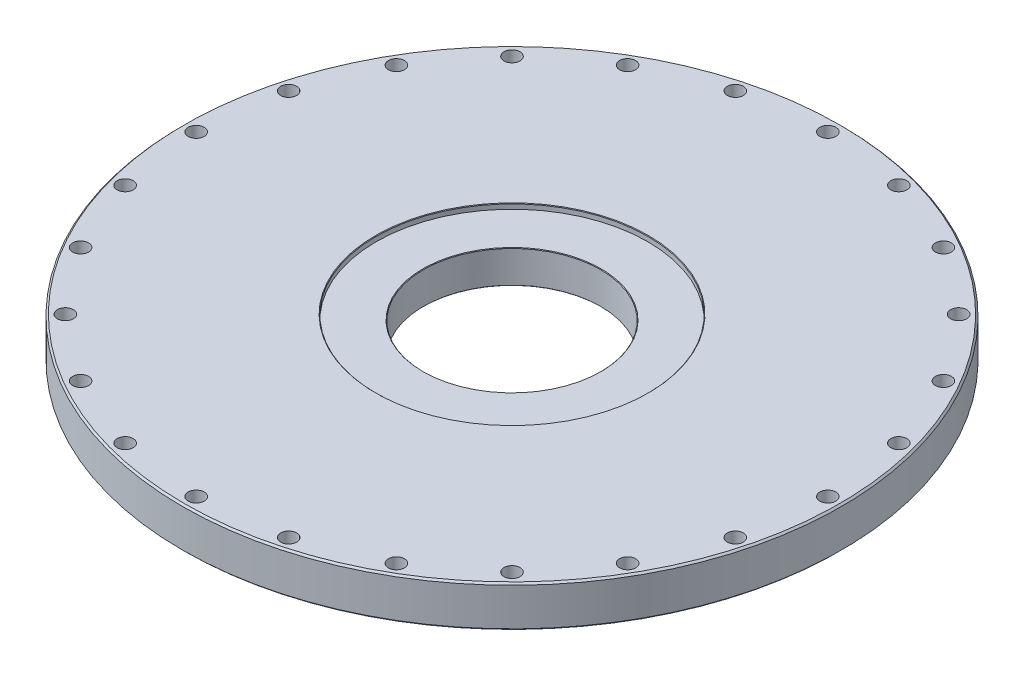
ISO-10303-21;
HEADER;
FILE_DESCRIPTION(('STEP AP214'),'2;1');
FILE_NAME('part.step','',(''),(''),'','','');
FILE_SCHEMA(('AUTOMOTIVE_DESIGN { 1 0 10303 214 1 1 1 1 }'));
ENDSEC;
DATA;
#1=APPLICATION_CONTEXT('core data for automotive mechanical design processes');
#2=APPLICATION_PROTOCOL_DEFINITION('international standard','automotive_design',2000,#1);
#3=PRODUCT_CONTEXT('',#1,'mechanical');
#4=PRODUCT('Part','Part','',(#3));
#5=PRODUCT_RELATED_PRODUCT_CATEGORY('part','',(#4));
#6=PRODUCT_DEFINITION_FORMATION('','',#4);
#7=PRODUCT_DEFINITION_CONTEXT('part definition',#1,'design');
#8=PRODUCT_DEFINITION('design','',#6,#7);
#9=PRODUCT_DEFINITION_SHAPE('','',#8);
#10=(LENGTH_UNIT() NAMED_UNIT(*) SI_UNIT(.MILLI.,.METRE.));
#11=(NAMED_UNIT(*) PLANE_ANGLE_UNIT() SI_UNIT($,.RADIAN.));
#12=(NAMED_UNIT(*) SI_UNIT($,.STERADIAN.) SOLID_ANGLE_UNIT());
#13=UNCERTAINTY_MEASURE_WITH_UNIT(LENGTH_MEASURE(1.E-05),#10,'distance_accuracy_value','');
#14=(GEOMETRIC_REPRESENTATION_CONTEXT(3) GLOBAL_UNCERTAINTY_ASSIGNED_CONTEXT((#13)) GLOBAL_UNIT_ASSIGNED_CONTEXT((#10,
#11,#12)) REPRESENTATION_CONTEXT('',''));
#15=CARTESIAN_POINT('',(0.,0.,0.));
#16=DIRECTION('',(0.,0.,1.));
#17=DIRECTION('',(1.,0.,0.));
#18=AXIS2_PLACEMENT_3D('',#15,#16,#17);
#19=CARTESIAN_POINT('',(0.,-218.122500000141,0.));
#20=DIRECTION('',(0.,-1.,0.));
#21=DIRECTION('',(0.,0.,-1.));
#22=AXIS2_PLACEMENT_3D('',#19,#20,#21);
#23=PLANE('',#22);
#24=CARTESIAN_POINT('',(0.,-218.122500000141,0.));
#25=DIRECTION('',(0.,-1.,0.));
#26=DIRECTION('',(0.,0.,-1.));
#27=AXIS2_PLACEMENT_3D('',#24,#25,#26);
#28=CIRCLE('',#27,82.408);
#29=CARTESIAN_POINT('',(0.,-218.122500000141,-82.408));
#30=VERTEX_POINT('',#29);
#31=EDGE_CURVE('E440',#30,#30,#28,.F.);
#32=ORIENTED_EDGE('',*,*,#31,.T.);
#33=EDGE_LOOP('',(#32));
#34=FACE_BOUND('',#33,.T.);
#35=CARTESIAN_POINT('',(0.,-218.122500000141,0.));
#36=DIRECTION('',(0.,-1.,0.));
#37=DIRECTION('',(0.,0.,-1.));
#38=AXIS2_PLACEMENT_3D('',#35,#36,#37);
#39=CIRCLE('',#38,85.8647);
#40=CARTESIAN_POINT('',(0.,-218.122500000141,-85.8647));
#41=VERTEX_POINT('',#40);
#42=EDGE_CURVE('E514',#41,#41,#39,.T.);
#43=ORIENTED_EDGE('',*,*,#42,.T.);
#44=EDGE_LOOP('',(#43));
#45=FACE_BOUND('',#44,.T.);
#46=ADVANCED_FACE('F42',(#34,#45),#23,.T.);
#47=CARTESIAN_POINT('',(0.,-249.408859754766,0.));
#48=DIRECTION('',(0.,-1.,0.));
#49=DIRECTION('',(0.,0.,-1.));
#50=AXIS2_PLACEMENT_3D('',#47,#48,#49);
#51=CYLINDRICAL_SURFACE('',#50,126.746);
#52=CARTESIAN_POINT('',(0.,-220.113860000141,0.));
#53=DIRECTION('',(0.,-1.,0.));
#54=DIRECTION('',(0.,0.,-1.));
#55=AXIS2_PLACEMENT_3D('',#52,#53,#54);
#56=CIRCLE('',#55,126.746);
#57=CARTESIAN_POINT('',(0.,-220.113860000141,-126.746));
#58=VERTEX_POINT('',#57);
#59=EDGE_CURVE('E422',#58,#58,#56,.F.);
#60=ORIENTED_EDGE('',*,*,#59,.T.);
#61=EDGE_LOOP('',(#60));
#62=FACE_BOUND('',#61,.T.);
#63=CARTESIAN_POINT('',(0.,-218.122500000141,0.));
#64=DIRECTION('',(0.,-1.,0.));
#65=DIRECTION('',(0.,0.,-1.));
#66=AXIS2_PLACEMENT_3D('',#63,#64,#65);
#67=CIRCLE('',#66,126.746);
#68=CARTESIAN_POINT('',(0.,-218.122500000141,-126.746));
#69=VERTEX_POINT('',#68);
#70=EDGE_CURVE('E407',#69,#69,#67,.T.);
#71=ORIENTED_EDGE('',*,*,#70,.T.);
#72=EDGE_LOOP('',(#71));
#73=FACE_BOUND('',#72,.T.);
#74=ADVANCED_FACE('F539',(#62,#73),#51,.T.);
#75=CARTESIAN_POINT('',(0.,-218.122500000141,0.));
#76=DIRECTION('',(0.,-1.,0.));
#77=DIRECTION('',(0.,0.,-1.));
#78=AXIS2_PLACEMENT_3D('',#75,#76,#77);
#79=PLANE('',#78);
#80=CARTESIAN_POINT('',(-177.8,-218.122500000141,0.));
#81=DIRECTION('',(0.,-1.,0.));
#82=DIRECTION('',(0.,0.,-1.));
#83=AXIS2_PLACEMENT_3D('',#80,#81,#82);
#84=CIRCLE('',#83,3.96874999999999);
#85=CARTESIAN_POINT('',(-177.8,-218.122500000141,-3.96875000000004));
#86=VERTEX_POINT('',#85);
#87=EDGE_CURVE('E209',#86,#86,#84,.T.);
#88=ORIENTED_EDGE('',*,*,#87,.F.);
#89=EDGE_LOOP('',(#88));
#90=FACE_BOUND('',#89,.T.);
#91=CARTESIAN_POINT('',(-153.979316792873,-218.122500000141,-88.9000000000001));
#92=DIRECTION('',(0.,-1.,0.));
#93=DIRECTION('',(0.,0.,-1.));
#94=AXIS2_PLACEMENT_3D('',#91,#92,#93);
#95=CIRCLE('',#94,3.96874999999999);
#96=CARTESIAN_POINT('',(-153.979316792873,-218.122500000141,-92.8687500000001));
#97=VERTEX_POINT('',#96);
#98=EDGE_CURVE('E213',#97,#97,#95,.T.);
#99=ORIENTED_EDGE('',*,*,#98,.F.);
#100=EDGE_LOOP('',(#99));
#101=FACE_BOUND('',#100,.T.);
#102=CARTESIAN_POINT('',(-88.8999999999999,-218.122500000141,-153.979316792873));
#103=DIRECTION('',(0.,-1.,0.));
#104=DIRECTION('',(0.,0.,-1.));
#105=AXIS2_PLACEMENT_3D('',#102,#103,#104);
#106=CIRCLE('',#105,3.96874999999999);
#107=CARTESIAN_POINT('',(-88.8999999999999,-218.122500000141,-157.948066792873));
#108=VERTEX_POINT('',#107);
#109=EDGE_CURVE('E217',#108,#108,#106,.T.);
#110=ORIENTED_EDGE('',*,*,#109,.F.);
#111=EDGE_LOOP('',(#110));
#112=FACE_BOUND('',#111,.T.);
#113=CARTESIAN_POINT('',(0.,-218.122500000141,-177.8));
#114=DIRECTION('',(0.,-1.,0.));
#115=DIRECTION('',(0.,0.,-1.));
#116=AXIS2_PLACEMENT_3D('',#113,#114,#115);
#117=CIRCLE('',#116,3.96874999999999);
#118=CARTESIAN_POINT('',(0.,-218.122500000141,-181.76875));
#119=VERTEX_POINT('',#118);
#120=EDGE_CURVE('E221',#119,#119,#117,.T.);
#121=ORIENTED_EDGE('',*,*,#120,.F.);
#122=EDGE_LOOP('',(#121));
#123=FACE_BOUND('',#122,.T.);
#124=CARTESIAN_POINT('',(88.9000000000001,-218.122500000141,-153.979316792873));
#125=DIRECTION('',(0.,-1.,0.));
#126=DIRECTION('',(0.,0.,-1.));
#127=AXIS2_PLACEMENT_3D('',#124,#125,#126);
#128=CIRCLE('',#127,3.96874999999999);
#129=CARTESIAN_POINT('',(88.9000000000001,-218.122500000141,-157.948066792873));
#130=VERTEX_POINT('',#129);
#131=EDGE_CURVE('E225',#130,#130,#128,.T.);
#132=ORIENTED_EDGE('',*,*,#131,.F.);
#133=EDGE_LOOP('',(#132));
#134=FACE_BOUND('',#133,.T.);
#135=CARTESIAN_POINT('',(153.979316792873,-218.122500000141,-88.8999999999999));
#136=DIRECTION('',(0.,-1.,0.));
#137=DIRECTION('',(0.,0.,-1.));
#138=AXIS2_PLACEMENT_3D('',#135,#136,#137);
#139=CIRCLE('',#138,3.96874999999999);
#140=CARTESIAN_POINT('',(153.979316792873,-218.122500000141,-92.8687499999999));
#141=VERTEX_POINT('',#140);
#142=EDGE_CURVE('E229',#141,#141,#139,.T.);
#143=ORIENTED_EDGE('',*,*,#142,.F.);
#144=EDGE_LOOP('',(#143));
#145=FACE_BOUND('',#144,.T.);
#146=CARTESIAN_POINT('',(177.8,-218.122500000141,0.));
#147=DIRECTION('',(0.,-1.,0.));
#148=DIRECTION('',(0.,0.,-1.));
#149=AXIS2_PLACEMENT_3D('',#146,#147,#148);
#150=CIRCLE('',#149,3.96874999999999);
#151=CARTESIAN_POINT('',(177.8,-218.122500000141,-3.96874999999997));
#152=VERTEX_POINT('',#151);
#153=EDGE_CURVE('E233',#152,#152,#150,.T.);
#154=ORIENTED_EDGE('',*,*,#153,.F.);
#155=EDGE_LOOP('',(#154));
#156=FACE_BOUND('',#155,.T.);
#157=CARTESIAN_POINT('',(153.979316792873,-218.122500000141,88.9));
#158=DIRECTION('',(0.,-1.,0.));
#159=DIRECTION('',(0.,0.,-1.));
#160=AXIS2_PLACEMENT_3D('',#157,#158,#159);
#161=CIRCLE('',#160,3.96874999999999);
#162=CARTESIAN_POINT('',(153.979316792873,-218.122500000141,84.93125));
#163=VERTEX_POINT('',#162);
#164=EDGE_CURVE('E237',#163,#163,#161,.T.);
#165=ORIENTED_EDGE('',*,*,#164,.F.);
#166=EDGE_LOOP('',(#165));
#167=FACE_BOUND('',#166,.T.);
#168=CARTESIAN_POINT('',(88.9,-218.122500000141,153.979316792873));
#169=DIRECTION('',(0.,-1.,0.));
#170=DIRECTION('',(0.,0.,-1.));
#171=AXIS2_PLACEMENT_3D('',#168,#169,#170);
#172=CIRCLE('',#171,3.96874999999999);
#173=CARTESIAN_POINT('',(88.9,-218.122500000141,150.010566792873));
#174=VERTEX_POINT('',#173);
#175=EDGE_CURVE('E241',#174,#174,#172,.T.);
#176=ORIENTED_EDGE('',*,*,#175,.F.);
#177=EDGE_LOOP('',(#176));
#178=FACE_BOUND('',#177,.T.);
#179=CARTESIAN_POINT('',(0.,-218.122500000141,177.8));
#180=DIRECTION('',(0.,-1.,0.));
#181=DIRECTION('',(0.,0.,-1.));
#182=AXIS2_PLACEMENT_3D('',#179,#180,#181);
#183=CIRCLE('',#182,3.96874999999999);
#184=CARTESIAN_POINT('',(0.,-218.122500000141,173.83125));
#185=VERTEX_POINT('',#184);
#186=EDGE_CURVE('E245',#185,#185,#183,.T.);
#187=ORIENTED_EDGE('',*,*,#186,.F.);
#188=EDGE_LOOP('',(#187));
#189=FACE_BOUND('',#188,.T.);
#190=CARTESIAN_POINT('',(-88.9,-218.122500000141,153.979316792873));
#191=DIRECTION('',(0.,-1.,0.));
#192=DIRECTION('',(0.,0.,-1.));
#193=AXIS2_PLACEMENT_3D('',#190,#191,#192);
#194=CIRCLE('',#193,3.96874999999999);
#195=CARTESIAN_POINT('',(-88.9,-218.122500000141,150.010566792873));
#196=VERTEX_POINT('',#195);
#197=EDGE_CURVE('E249',#196,#196,#194,.T.);
#198=ORIENTED_EDGE('',*,*,#197,.F.);
#199=EDGE_LOOP('',(#198));
#200=FACE_BOUND('',#199,.T.);
#201=CARTESIAN_POINT('',(-153.979316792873,-218.122500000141,88.8999999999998));
#202=DIRECTION('',(0.,-1.,0.));
#203=DIRECTION('',(0.,0.,-1.));
#204=AXIS2_PLACEMENT_3D('',#201,#202,#203);
#205=CIRCLE('',#204,3.96874999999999);
#206=CARTESIAN_POINT('',(-153.979316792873,-218.122500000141,84.9312499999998));
#207=VERTEX_POINT('',#206);
#208=EDGE_CURVE('E253',#207,#207,#205,.T.);
#209=ORIENTED_EDGE('',*,*,#208,.F.);
#210=EDGE_LOOP('',(#209));
#211=FACE_BOUND('',#210,.T.);
#212=CARTESIAN_POINT('',(0.,-218.122500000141,0.));
#213=DIRECTION('',(0.,-1.,0.));
#214=DIRECTION('',(0.,0.,-1.));
#215=AXIS2_PLACEMENT_3D('',#212,#213,#214);
#216=CIRCLE('',#215,203.454);
#217=CARTESIAN_POINT('',(0.,-218.122500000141,-203.454));
#218=VERTEX_POINT('',#217);
#219=EDGE_CURVE('E404',#218,#218,#216,.T.);
#220=ORIENTED_EDGE('',*,*,#219,.T.);
#221=EDGE_LOOP('',(#220));
#222=FACE_BOUND('',#221,.T.);
#223=ORIENTED_EDGE('',*,*,#70,.F.);
#224=EDGE_LOOP('',(#223));
#225=FACE_BOUND('',#224,.T.);
#226=ADVANCED_FACE('F544',(#90,#101,#112,#123,#134,#145,#156,#167,#178,#189,#200,#211,#222,
#225),#79,.T.);
#227=CARTESIAN_POINT('',(0.,-249.408859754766,0.));
#228=DIRECTION('',(0.,-1.,0.));
#229=DIRECTION('',(0.,0.,-1.));
#230=AXIS2_PLACEMENT_3D('',#227,#228,#229);
#231=CYLINDRICAL_SURFACE('',#230,203.454);
#232=CARTESIAN_POINT('',(0.,-220.550740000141,0.));
#233=DIRECTION('',(0.,-1.,0.));
#234=DIRECTION('',(0.,0.,-1.));
#235=AXIS2_PLACEMENT_3D('',#232,#233,#234);
#236=CIRCLE('',#235,203.454);
#237=CARTESIAN_POINT('',(0.,-220.550740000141,-203.454));
#238=VERTEX_POINT('',#237);
#239=EDGE_CURVE('E428',#238,#238,#236,.T.);
#240=ORIENTED_EDGE('',*,*,#239,.T.);
#241=EDGE_LOOP('',(#240));
#242=FACE_BOUND('',#241,.T.);
#243=ORIENTED_EDGE('',*,*,#219,.F.);
#244=EDGE_LOOP('',(#243));
#245=FACE_BOUND('',#244,.T.);
#246=ADVANCED_FACE('F570',(#242,#245),#231,.F.);
#247=CARTESIAN_POINT('',(0.,-221.058740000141,0.));
#248=DIRECTION('',(0.,-1.,0.));
#249=DIRECTION('',(0.,0.,-1.));
#250=AXIS2_PLACEMENT_3D('',#247,#248,#249);
#251=PLANE('',#250);
#252=CARTESIAN_POINT('',(0.,-221.058740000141,0.));
#253=DIRECTION('',(0.,-1.,0.));
#254=DIRECTION('',(0.,0.,-1.));
#255=AXIS2_PLACEMENT_3D('',#252,#253,#254);
#256=CIRCLE('',#255,303.2125);
#257=CARTESIAN_POINT('',(0.,-221.058740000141,303.2125));
#258=VERTEX_POINT('',#257);
#259=EDGE_CURVE('E455',#258,#258,#256,.T.);
#260=ORIENTED_EDGE('',*,*,#259,.T.);
#261=EDGE_LOOP('',(#260));
#262=FACE_BOUND('',#261,.T.);
#263=CARTESIAN_POINT('',(0.,-221.058740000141,0.));
#264=DIRECTION('',(0.,-1.,0.));
#265=DIRECTION('',(0.,0.,-1.));
#266=AXIS2_PLACEMENT_3D('',#263,#264,#265);
#267=CIRCLE('',#266,203.962);
#268=CARTESIAN_POINT('',(0.,-221.058740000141,-203.962));
#269=VERTEX_POINT('',#268);
#270=EDGE_CURVE('E431',#269,#269,#267,.F.);
#271=ORIENTED_EDGE('',*,*,#270,.T.);
#272=EDGE_LOOP('',(#271));
#273=FACE_BOUND('',#272,.T.);
#274=CARTESIAN_POINT('',(-75.6010430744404,-221.058740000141,-282.146933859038));
#275=DIRECTION('',(0.,-1.,0.));
#276=DIRECTION('',(-0.965925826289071,0.,0.258819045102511));
#277=AXIS2_PLACEMENT_3D('',#274,#275,#276);
#278=CIRCLE('',#277,7.39774999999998);
#279=CARTESIAN_POINT('',(-82.7467208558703,-221.058740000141,-280.232255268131));
#280=VERTEX_POINT('',#279);
#281=EDGE_CURVE('E332',#280,#280,#278,.T.);
#282=ORIENTED_EDGE('',*,*,#281,.F.);
#283=EDGE_LOOP('',(#282));
#284=FACE_BOUND('',#283,.T.);
#285=CARTESIAN_POINT('',(-146.049999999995,-221.058740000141,-252.966020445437));
#286=DIRECTION('',(0.,-1.,0.));
#287=DIRECTION('',(-0.866025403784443,0.,0.499999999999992));
#288=AXIS2_PLACEMENT_3D('',#285,#286,#287);
#289=CIRCLE('',#288,7.39774999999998);
#290=CARTESIAN_POINT('',(-152.456639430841,-221.058740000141,-249.267145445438));
#291=VERTEX_POINT('',#290);
#292=EDGE_CURVE('E326',#291,#291,#289,.T.);
#293=ORIENTED_EDGE('',*,*,#292,.F.);
#294=EDGE_LOOP('',(#293));
#295=FACE_BOUND('',#294,.T.);
#296=CARTESIAN_POINT('',(-206.545890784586,-221.058740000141,-206.545890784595));
#297=DIRECTION('',(0.,-1.,0.));
#298=DIRECTION('',(-0.707106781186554,0.,0.707106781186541));
#299=AXIS2_PLACEMENT_3D('',#296,#297,#298);
#300=CIRCLE('',#299,7.39774999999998);
#301=CARTESIAN_POINT('',(-211.776889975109,-221.058740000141,-201.314891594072));
#302=VERTEX_POINT('',#301);
#303=EDGE_CURVE('E320',#302,#302,#300,.T.);
#304=ORIENTED_EDGE('',*,*,#303,.F.);
#305=EDGE_LOOP('',(#304));
#306=FACE_BOUND('',#305,.T.);
#307=CARTESIAN_POINT('',(-252.966020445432,-221.058740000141,-146.050000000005));
#308=DIRECTION('',(0.,-1.,0.));
#309=DIRECTION('',(-0.500000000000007,0.,0.866025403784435));
#310=AXIS2_PLACEMENT_3D('',#307,#308,#309);
#311=CIRCLE('',#310,7.39774999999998);
#312=CARTESIAN_POINT('',(-256.664895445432,-221.058740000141,-139.643360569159));
#313=VERTEX_POINT('',#312);
#314=EDGE_CURVE('E314',#313,#313,#311,.T.);
#315=ORIENTED_EDGE('',*,*,#314,.F.);
#316=EDGE_LOOP('',(#315));
#317=FACE_BOUND('',#316,.T.);
#318=CARTESIAN_POINT('',(-282.146933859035,-221.058740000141,-75.6010430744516));
#319=DIRECTION('',(0.,-1.,0.));
#320=DIRECTION('',(-0.258819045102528,0.,0.965925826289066));
#321=AXIS2_PLACEMENT_3D('',#318,#319,#320);
#322=CIRCLE('',#321,7.39774999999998);
#323=CARTESIAN_POINT('',(-284.061612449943,-221.058740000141,-68.4553652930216));
#324=VERTEX_POINT('',#323);
#325=EDGE_CURVE('E308',#324,#324,#322,.T.);
#326=ORIENTED_EDGE('',*,*,#325,.F.);
#327=EDGE_LOOP('',(#326));
#328=FACE_BOUND('',#327,.T.);
#329=CARTESIAN_POINT('',(-292.1,-221.058740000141,-3.23587823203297E-12));
#330=DIRECTION('',(0.,-1.,0.));
#331=DIRECTION('',(0.,0.,1.));
#332=AXIS2_PLACEMENT_3D('',#329,#330,#331);
#333=CIRCLE('',#332,7.39774999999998);
#334=CARTESIAN_POINT('',(-292.1,-221.058740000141,7.39774999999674));
#335=VERTEX_POINT('',#334);
#336=EDGE_CURVE('E302',#335,#335,#333,.T.);
#337=ORIENTED_EDGE('',*,*,#336,.F.);
#338=EDGE_LOOP('',(#337));
#339=FACE_BOUND('',#338,.T.);
#340=CARTESIAN_POINT('',(-282.146933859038,-221.058740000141,75.6010430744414));
#341=DIRECTION('',(0.,-1.,0.));
#342=DIRECTION('',(0.258819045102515,0.,0.96592582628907));
#343=AXIS2_PLACEMENT_3D('',#340,#341,#342);
#344=CIRCLE('',#343,7.39774999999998);
#345=CARTESIAN_POINT('',(-280.232255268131,-221.058740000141,82.7467208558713));
#346=VERTEX_POINT('',#345);
#347=EDGE_CURVE('E295',#346,#346,#344,.T.);
#348=ORIENTED_EDGE('',*,*,#347,.F.);
#349=EDGE_LOOP('',(#348));
#350=FACE_BOUND('',#349,.T.);
#351=CARTESIAN_POINT('',(-252.966020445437,-221.058740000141,146.049999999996));
#352=DIRECTION('',(0.,-1.,0.));
#353=DIRECTION('',(0.499999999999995,0.,0.866025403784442));
#354=AXIS2_PLACEMENT_3D('',#351,#352,#353);
#355=CIRCLE('',#354,7.39774999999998);
#356=CARTESIAN_POINT('',(-249.267145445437,-221.058740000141,152.456639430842));
#357=VERTEX_POINT('',#356);
#358=EDGE_CURVE('E294',#357,#357,#355,.T.);
#359=ORIENTED_EDGE('',*,*,#358,.F.);
#360=EDGE_LOOP('',(#359));
#361=FACE_BOUND('',#360,.T.);
#362=CARTESIAN_POINT('',(-206.545890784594,-221.058740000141,206.545890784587));
#363=DIRECTION('',(0.,-1.,0.));
#364=DIRECTION('',(0.707106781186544,0.,0.707106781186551));
#365=AXIS2_PLACEMENT_3D('',#362,#363,#364);
#366=CIRCLE('',#365,7.39774999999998);
#367=CARTESIAN_POINT('',(-201.314891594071,-221.058740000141,211.77688997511));
#368=VERTEX_POINT('',#367);
#369=EDGE_CURVE('E380',#368,#368,#366,.T.);
#370=ORIENTED_EDGE('',*,*,#369,.F.);
#371=EDGE_LOOP('',(#370));
#372=FACE_BOUND('',#371,.T.);
#373=CARTESIAN_POINT('',(-146.050000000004,-221.058740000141,252.966020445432));
#374=DIRECTION('',(0.,-1.,0.));
#375=DIRECTION('',(0.866025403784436,0.,0.500000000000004));
#376=AXIS2_PLACEMENT_3D('',#373,#374,#375);
#377=CIRCLE('',#376,7.39774999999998);
#378=CARTESIAN_POINT('',(-139.643360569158,-221.058740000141,256.664895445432));
#379=VERTEX_POINT('',#378);
#380=EDGE_CURVE('E374',#379,#379,#377,.T.);
#381=ORIENTED_EDGE('',*,*,#380,.F.);
#382=EDGE_LOOP('',(#381));
#383=FACE_BOUND('',#382,.T.);
#384=CARTESIAN_POINT('',(-75.6010430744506,-221.058740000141,282.146933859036));
#385=DIRECTION('',(0.,-1.,0.));
#386=DIRECTION('',(0.965925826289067,0.,0.258819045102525));
#387=AXIS2_PLACEMENT_3D('',#384,#385,#386);
#388=CIRCLE('',#387,7.39774999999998);
#389=CARTESIAN_POINT('',(-68.4553652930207,-221.058740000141,284.061612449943));
#390=VERTEX_POINT('',#389);
#391=EDGE_CURVE('E368',#390,#390,#388,.T.);
#392=ORIENTED_EDGE('',*,*,#391,.F.);
#393=EDGE_LOOP('',(#392));
#394=FACE_BOUND('',#393,.T.);
#395=CARTESIAN_POINT('',(-4.25573993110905E-12,-221.058740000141,292.1));
#396=DIRECTION('',(0.,-1.,0.));
#397=DIRECTION('',(1.,0.,0.));
#398=AXIS2_PLACEMENT_3D('',#395,#396,#397);
#399=CIRCLE('',#398,7.39774999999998);
#400=CARTESIAN_POINT('',(7.39774999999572,-221.058740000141,292.1));
#401=VERTEX_POINT('',#400);
#402=EDGE_CURVE('E362',#401,#401,#399,.T.);
#403=ORIENTED_EDGE('',*,*,#402,.F.);
#404=EDGE_LOOP('',(#403));
#405=FACE_BOUND('',#404,.T.);
#406=CARTESIAN_POINT('',(75.6010430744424,-221.058740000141,282.146933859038));
#407=DIRECTION('',(0.,-1.,0.));
#408=DIRECTION('',(0.965925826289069,0.,-0.258819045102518));
#409=AXIS2_PLACEMENT_3D('',#406,#407,#408);
#410=CIRCLE('',#409,7.39774999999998);
#411=CARTESIAN_POINT('',(82.7467208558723,-221.058740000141,280.232255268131));
#412=VERTEX_POINT('',#411);
#413=EDGE_CURVE('E356',#412,#412,#410,.T.);
#414=ORIENTED_EDGE('',*,*,#413,.F.);
#415=EDGE_LOOP('',(#414));
#416=FACE_BOUND('',#415,.T.);
#417=CARTESIAN_POINT('',(146.049999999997,-221.058740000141,252.966020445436));
#418=DIRECTION('',(0.,-1.,0.));
#419=DIRECTION('',(0.86602540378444,0.,-0.499999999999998));
#420=AXIS2_PLACEMENT_3D('',#417,#418,#419);
#421=CIRCLE('',#420,7.39774999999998);
#422=CARTESIAN_POINT('',(152.456639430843,-221.058740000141,249.267145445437));
#423=VERTEX_POINT('',#422);
#424=EDGE_CURVE('E350',#423,#423,#421,.T.);
#425=ORIENTED_EDGE('',*,*,#424,.F.);
#426=EDGE_LOOP('',(#425));
#427=FACE_BOUND('',#426,.T.);
#428=CARTESIAN_POINT('',(206.545890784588,-221.058740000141,206.545890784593));
#429=DIRECTION('',(0.,-1.,0.));
#430=DIRECTION('',(0.707106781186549,0.,-0.707106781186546));
#431=AXIS2_PLACEMENT_3D('',#428,#429,#430);
#432=CIRCLE('',#431,7.39774999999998);
#433=CARTESIAN_POINT('',(211.776889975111,-221.058740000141,201.31489159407));
#434=VERTEX_POINT('',#433);
#435=EDGE_CURVE('E343',#434,#434,#432,.T.);
#436=ORIENTED_EDGE('',*,*,#435,.F.);
#437=EDGE_LOOP('',(#436));
#438=FACE_BOUND('',#437,.T.);
#439=CARTESIAN_POINT('',(252.966020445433,-221.058740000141,146.050000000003));
#440=DIRECTION('',(0.,-1.,0.));
#441=DIRECTION('',(0.500000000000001,0.,-0.866025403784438));
#442=AXIS2_PLACEMENT_3D('',#439,#440,#441);
#443=CIRCLE('',#442,7.39774999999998);
#444=CARTESIAN_POINT('',(256.664895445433,-221.058740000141,139.643360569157));
#445=VERTEX_POINT('',#444);
#446=EDGE_CURVE('E342',#445,#445,#443,.T.);
#447=ORIENTED_EDGE('',*,*,#446,.F.);
#448=EDGE_LOOP('',(#447));
#449=FACE_BOUND('',#448,.T.);
#450=CARTESIAN_POINT('',(6.29546332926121E-12,-221.058740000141,-292.1));
#451=DIRECTION('',(0.,-1.,0.));
#452=DIRECTION('',(-1.,0.,0.));
#453=AXIS2_PLACEMENT_3D('',#450,#451,#452);
#454=CIRCLE('',#453,7.39774999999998);
#455=CARTESIAN_POINT('',(-7.39774999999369,-221.058740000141,-292.1));
#456=VERTEX_POINT('',#455);
#457=EDGE_CURVE('E257',#456,#456,#454,.T.);
#458=ORIENTED_EDGE('',*,*,#457,.F.);
#459=EDGE_LOOP('',(#458));
#460=FACE_BOUND('',#459,.T.);
#461=CARTESIAN_POINT('',(75.6010430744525,-221.058740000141,-282.146933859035));
#462=DIRECTION('',(0.,-1.,0.));
#463=DIRECTION('',(-0.965925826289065,0.,-0.258819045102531));
#464=AXIS2_PLACEMENT_3D('',#461,#462,#463);
#465=CIRCLE('',#464,7.39774999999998);
#466=CARTESIAN_POINT('',(68.4553652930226,-221.058740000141,-284.061612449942));
#467=VERTEX_POINT('',#466);
#468=EDGE_CURVE('E258',#467,#467,#465,.T.);
#469=ORIENTED_EDGE('',*,*,#468,.F.);
#470=EDGE_LOOP('',(#469));
#471=FACE_BOUND('',#470,.T.);
#472=CARTESIAN_POINT('',(146.050000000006,-221.058740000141,-252.966020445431));
#473=DIRECTION('',(0.,-1.,0.));
#474=DIRECTION('',(-0.866025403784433,0.,-0.50000000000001));
#475=AXIS2_PLACEMENT_3D('',#472,#473,#474);
#476=CIRCLE('',#475,7.39774999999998);
#477=CARTESIAN_POINT('',(139.643360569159,-221.058740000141,-256.664895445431));
#478=VERTEX_POINT('',#477);
#479=EDGE_CURVE('E265',#478,#478,#476,.T.);
#480=ORIENTED_EDGE('',*,*,#479,.F.);
#481=EDGE_LOOP('',(#480));
#482=FACE_BOUND('',#481,.T.);
#483=CARTESIAN_POINT('',(206.545890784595,-221.058740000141,-206.545890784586));
#484=DIRECTION('',(0.,-1.,0.));
#485=DIRECTION('',(-0.707106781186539,0.,-0.707106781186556));
#486=AXIS2_PLACEMENT_3D('',#483,#484,#485);
#487=CIRCLE('',#486,7.39774999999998);
#488=CARTESIAN_POINT('',(201.314891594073,-221.058740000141,-211.776889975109));
#489=VERTEX_POINT('',#488);
#490=EDGE_CURVE('E271',#489,#489,#487,.T.);
#491=ORIENTED_EDGE('',*,*,#490,.F.);
#492=EDGE_LOOP('',(#491));
#493=FACE_BOUND('',#492,.T.);
#494=CARTESIAN_POINT('',(252.966020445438,-221.058740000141,-146.049999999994));
#495=DIRECTION('',(0.,-1.,0.));
#496=DIRECTION('',(-0.499999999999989,0.,-0.866025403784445));
#497=AXIS2_PLACEMENT_3D('',#494,#495,#496);
#498=CIRCLE('',#497,7.39774999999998);
#499=CARTESIAN_POINT('',(249.267145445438,-221.058740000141,-152.45663943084));
#500=VERTEX_POINT('',#499);
#501=EDGE_CURVE('E277',#500,#500,#498,.T.);
#502=ORIENTED_EDGE('',*,*,#501,.F.);
#503=EDGE_LOOP('',(#502));
#504=FACE_BOUND('',#503,.T.);
#505=CARTESIAN_POINT('',(282.146933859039,-221.058740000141,-75.6010430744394));
#506=DIRECTION('',(0.,-1.,0.));
#507=DIRECTION('',(-0.258819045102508,0.,-0.965925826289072));
#508=AXIS2_PLACEMENT_3D('',#505,#506,#507);
#509=CIRCLE('',#508,7.39774999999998);
#510=CARTESIAN_POINT('',(280.232255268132,-221.058740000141,-82.7467208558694));
#511=VERTEX_POINT('',#510);
#512=EDGE_CURVE('E283',#511,#511,#509,.T.);
#513=ORIENTED_EDGE('',*,*,#512,.F.);
#514=EDGE_LOOP('',(#513));
#515=FACE_BOUND('',#514,.T.);
#516=CARTESIAN_POINT('',(282.146933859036,-221.058740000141,75.6010430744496));
#517=DIRECTION('',(0.,-1.,0.));
#518=DIRECTION('',(0.258819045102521,0.,-0.965925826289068));
#519=AXIS2_PLACEMENT_3D('',#516,#517,#518);
#520=CIRCLE('',#519,7.39774999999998);
#521=CARTESIAN_POINT('',(284.061612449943,-221.058740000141,68.4553652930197));
#522=VERTEX_POINT('',#521);
#523=EDGE_CURVE('E389',#522,#522,#520,.T.);
#524=ORIENTED_EDGE('',*,*,#523,.F.);
#525=EDGE_LOOP('',(#524));
#526=FACE_BOUND('',#525,.T.);
#527=CARTESIAN_POINT('',(292.1,-221.058740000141,3.23587823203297E-12));
#528=DIRECTION('',(0.,-1.,0.));
#529=DIRECTION('',(0.,0.,-1.));
#530=AXIS2_PLACEMENT_3D('',#527,#528,#529);
#531=CIRCLE('',#530,7.39774999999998);
#532=CARTESIAN_POINT('',(292.1,-221.058740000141,-7.39774999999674));
#533=VERTEX_POINT('',#532);
#534=EDGE_CURVE('E392',#533,#533,#531,.T.);
#535=ORIENTED_EDGE('',*,*,#534,.F.);
#536=EDGE_LOOP('',(#535));
#537=FACE_BOUND('',#536,.T.);
#538=ADVANCED_FACE('F566',(#262,#273,#284,#295,#306,#317,#328,#339,#350,#361,#372,#383,#394,
#405,#416,#427,#438,#449,#460,#471,#482,#493,#504,#515,#526,#537),#251,.T.);
#539=CARTESIAN_POINT('',(0.,-249.408859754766,0.));
#540=DIRECTION('',(0.,-1.,0.));
#541=DIRECTION('',(0.,0.,-1.));
#542=AXIS2_PLACEMENT_3D('',#539,#540,#541);
#543=CYLINDRICAL_SURFACE('',#542,304.8);
#544=CARTESIAN_POINT('',(0.,-184.546240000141,0.));
#545=DIRECTION('',(0.,-1.,0.));
#546=DIRECTION('',(0.,0.,-1.));
#547=AXIS2_PLACEMENT_3D('',#544,#545,#546);
#548=CIRCLE('',#547,304.8);
#549=CARTESIAN_POINT('',(0.,-184.546240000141,-304.8));
#550=VERTEX_POINT('',#549);
#551=EDGE_CURVE('E449',#550,#550,#548,.T.);
#552=ORIENTED_EDGE('',*,*,#551,.T.);
#553=EDGE_LOOP('',(#552));
#554=FACE_BOUND('',#553,.T.);
#555=CARTESIAN_POINT('',(0.,-219.471240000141,0.));
#556=DIRECTION('',(0.,-1.,0.));
#557=DIRECTION('',(0.,0.,-1.));
#558=AXIS2_PLACEMENT_3D('',#555,#556,#557);
#559=CIRCLE('',#558,304.8);
#560=CARTESIAN_POINT('',(0.,-219.471240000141,304.8));
#561=VERTEX_POINT('',#560);
#562=EDGE_CURVE('E446',#561,#561,#559,.F.);
#563=ORIENTED_EDGE('',*,*,#562,.T.);
#564=EDGE_LOOP('',(#563));
#565=FACE_BOUND('',#564,.T.);
#566=ADVANCED_FACE('F562',(#554,#565),#543,.T.);
#567=CARTESIAN_POINT('',(0.,-182.958740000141,0.));
#568=DIRECTION('',(0.,-1.,0.));
#569=DIRECTION('',(0.,0.,-1.));
#570=AXIS2_PLACEMENT_3D('',#567,#568,#569);
#571=PLANE('',#570);
#572=CARTESIAN_POINT('',(0.,-182.958740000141,0.));
#573=DIRECTION('',(0.,-1.,0.));
#574=DIRECTION('',(0.,0.,-1.));
#575=AXIS2_PLACEMENT_3D('',#572,#573,#574);
#576=CIRCLE('',#575,303.2125);
#577=CARTESIAN_POINT('',(0.,-182.958740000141,-303.2125));
#578=VERTEX_POINT('',#577);
#579=EDGE_CURVE('E452',#578,#578,#576,.F.);
#580=ORIENTED_EDGE('',*,*,#579,.T.);
#581=EDGE_LOOP('',(#580));
#582=FACE_BOUND('',#581,.T.);
#583=CARTESIAN_POINT('',(0.,-182.958740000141,0.));
#584=DIRECTION('',(0.,-1.,0.));
#585=DIRECTION('',(0.,0.,-1.));
#586=AXIS2_PLACEMENT_3D('',#583,#584,#585);
#587=CIRCLE('',#586,126.1745);
#588=CARTESIAN_POINT('',(0.,-182.958740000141,-126.1745));
#589=VERTEX_POINT('',#588);
#590=EDGE_CURVE('E410',#589,#589,#587,.T.);
#591=ORIENTED_EDGE('',*,*,#590,.T.);
#592=EDGE_LOOP('',(#591));
#593=FACE_BOUND('',#592,.T.);
#594=CARTESIAN_POINT('',(-75.6010430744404,-182.958740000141,-282.146933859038));
#595=DIRECTION('',(0.,-1.,0.));
#596=DIRECTION('',(-0.965925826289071,0.,0.258819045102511));
#597=AXIS2_PLACEMENT_3D('',#594,#595,#596);
#598=CIRCLE('',#597,7.39774999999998);
#599=CARTESIAN_POINT('',(-82.7467208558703,-182.958740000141,-280.232255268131));
#600=VERTEX_POINT('',#599);
#601=EDGE_CURVE('E261',#600,#600,#598,.T.);
#602=ORIENTED_EDGE('',*,*,#601,.T.);
#603=EDGE_LOOP('',(#602));
#604=FACE_BOUND('',#603,.T.);
#605=CARTESIAN_POINT('',(-146.049999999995,-182.958740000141,-252.966020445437));
#606=DIRECTION('',(0.,-1.,0.));
#607=DIRECTION('',(-0.866025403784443,0.,0.499999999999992));
#608=AXIS2_PLACEMENT_3D('',#605,#606,#607);
#609=CIRCLE('',#608,7.39774999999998);
#610=CARTESIAN_POINT('',(-152.456639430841,-182.958740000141,-249.267145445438));
#611=VERTEX_POINT('',#610);
#612=EDGE_CURVE('E329',#611,#611,#609,.T.);
#613=ORIENTED_EDGE('',*,*,#612,.T.);
#614=EDGE_LOOP('',(#613));
#615=FACE_BOUND('',#614,.T.);
#616=CARTESIAN_POINT('',(-206.545890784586,-182.958740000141,-206.545890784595));
#617=DIRECTION('',(0.,-1.,0.));
#618=DIRECTION('',(-0.707106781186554,0.,0.707106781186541));
#619=AXIS2_PLACEMENT_3D('',#616,#617,#618);
#620=CIRCLE('',#619,7.39774999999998);
#621=CARTESIAN_POINT('',(-211.776889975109,-182.958740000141,-201.314891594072));
#622=VERTEX_POINT('',#621);
#623=EDGE_CURVE('E323',#622,#622,#620,.T.);
#624=ORIENTED_EDGE('',*,*,#623,.T.);
#625=EDGE_LOOP('',(#624));
#626=FACE_BOUND('',#625,.T.);
#627=CARTESIAN_POINT('',(-252.966020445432,-182.958740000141,-146.050000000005));
#628=DIRECTION('',(0.,-1.,0.));
#629=DIRECTION('',(-0.500000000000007,0.,0.866025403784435));
#630=AXIS2_PLACEMENT_3D('',#627,#628,#629);
#631=CIRCLE('',#630,7.39774999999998);
#632=CARTESIAN_POINT('',(-256.664895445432,-182.958740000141,-139.643360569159));
#633=VERTEX_POINT('',#632);
#634=EDGE_CURVE('E317',#633,#633,#631,.T.);
#635=ORIENTED_EDGE('',*,*,#634,.T.);
#636=EDGE_LOOP('',(#635));
#637=FACE_BOUND('',#636,.T.);
#638=CARTESIAN_POINT('',(-282.146933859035,-182.958740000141,-75.6010430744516));
#639=DIRECTION('',(0.,-1.,0.));
#640=DIRECTION('',(-0.258819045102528,0.,0.965925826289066));
#641=AXIS2_PLACEMENT_3D('',#638,#639,#640);
#642=CIRCLE('',#641,7.39774999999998);
#643=CARTESIAN_POINT('',(-284.061612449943,-182.958740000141,-68.4553652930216));
#644=VERTEX_POINT('',#643);
#645=EDGE_CURVE('E311',#644,#644,#642,.T.);
#646=ORIENTED_EDGE('',*,*,#645,.T.);
#647=EDGE_LOOP('',(#646));
#648=FACE_BOUND('',#647,.T.);
#649=CARTESIAN_POINT('',(-292.1,-182.958740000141,-3.23587823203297E-12));
#650=DIRECTION('',(0.,-1.,0.));
#651=DIRECTION('',(0.,0.,1.));
#652=AXIS2_PLACEMENT_3D('',#649,#650,#651);
#653=CIRCLE('',#652,7.39774999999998);
#654=CARTESIAN_POINT('',(-292.1,-182.958740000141,7.39774999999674));
#655=VERTEX_POINT('',#654);
#656=EDGE_CURVE('E305',#655,#655,#653,.T.);
#657=ORIENTED_EDGE('',*,*,#656,.T.);
#658=EDGE_LOOP('',(#657));
#659=FACE_BOUND('',#658,.T.);
#660=CARTESIAN_POINT('',(-282.146933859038,-182.958740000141,75.6010430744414));
#661=DIRECTION('',(0.,-1.,0.));
#662=DIRECTION('',(0.258819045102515,0.,0.96592582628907));
#663=AXIS2_PLACEMENT_3D('',#660,#661,#662);
#664=CIRCLE('',#663,7.39774999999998);
#665=CARTESIAN_POINT('',(-280.232255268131,-182.958740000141,82.7467208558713));
#666=VERTEX_POINT('',#665);
#667=EDGE_CURVE('E299',#666,#666,#664,.T.);
#668=ORIENTED_EDGE('',*,*,#667,.T.);
#669=EDGE_LOOP('',(#668));
#670=FACE_BOUND('',#669,.T.);
#671=CARTESIAN_POINT('',(-252.966020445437,-182.958740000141,146.049999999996));
#672=DIRECTION('',(0.,-1.,0.));
#673=DIRECTION('',(0.499999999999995,0.,0.866025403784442));
#674=AXIS2_PLACEMENT_3D('',#671,#672,#673);
#675=CIRCLE('',#674,7.39774999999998);
#676=CARTESIAN_POINT('',(-249.267145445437,-182.958740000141,152.456639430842));
#677=VERTEX_POINT('',#676);
#678=EDGE_CURVE('E291',#677,#677,#675,.T.);
#679=ORIENTED_EDGE('',*,*,#678,.T.);
#680=EDGE_LOOP('',(#679));
#681=FACE_BOUND('',#680,.T.);
#682=CARTESIAN_POINT('',(-206.545890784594,-182.958740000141,206.545890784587));
#683=DIRECTION('',(0.,-1.,0.));
#684=DIRECTION('',(0.707106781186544,0.,0.707106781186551));
#685=AXIS2_PLACEMENT_3D('',#682,#683,#684);
#686=CIRCLE('',#685,7.39774999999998);
#687=CARTESIAN_POINT('',(-201.314891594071,-182.958740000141,211.77688997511));
#688=VERTEX_POINT('',#687);
#689=EDGE_CURVE('E298',#688,#688,#686,.T.);
#690=ORIENTED_EDGE('',*,*,#689,.T.);
#691=EDGE_LOOP('',(#690));
#692=FACE_BOUND('',#691,.T.);
#693=CARTESIAN_POINT('',(-146.050000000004,-182.958740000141,252.966020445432));
#694=DIRECTION('',(0.,-1.,0.));
#695=DIRECTION('',(0.866025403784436,0.,0.500000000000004));
#696=AXIS2_PLACEMENT_3D('',#693,#694,#695);
#697=CIRCLE('',#696,7.39774999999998);
#698=CARTESIAN_POINT('',(-139.643360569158,-182.958740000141,256.664895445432));
#699=VERTEX_POINT('',#698);
#700=EDGE_CURVE('E377',#699,#699,#697,.T.);
#701=ORIENTED_EDGE('',*,*,#700,.T.);
#702=EDGE_LOOP('',(#701));
#703=FACE_BOUND('',#702,.T.);
#704=CARTESIAN_POINT('',(-75.6010430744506,-182.958740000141,282.146933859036));
#705=DIRECTION('',(0.,-1.,0.));
#706=DIRECTION('',(0.965925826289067,0.,0.258819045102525));
#707=AXIS2_PLACEMENT_3D('',#704,#705,#706);
#708=CIRCLE('',#707,7.39774999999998);
#709=CARTESIAN_POINT('',(-68.4553652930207,-182.958740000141,284.061612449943));
#710=VERTEX_POINT('',#709);
#711=EDGE_CURVE('E371',#710,#710,#708,.T.);
#712=ORIENTED_EDGE('',*,*,#711,.T.);
#713=EDGE_LOOP('',(#712));
#714=FACE_BOUND('',#713,.T.);
#715=CARTESIAN_POINT('',(-4.25573993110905E-12,-182.958740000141,292.1));
#716=DIRECTION('',(0.,-1.,0.));
#717=DIRECTION('',(1.,0.,0.));
#718=AXIS2_PLACEMENT_3D('',#715,#716,#717);
#719=CIRCLE('',#718,7.39774999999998);
#720=CARTESIAN_POINT('',(7.39774999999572,-182.958740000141,292.1));
#721=VERTEX_POINT('',#720);
#722=EDGE_CURVE('E365',#721,#721,#719,.T.);
#723=ORIENTED_EDGE('',*,*,#722,.T.);
#724=EDGE_LOOP('',(#723));
#725=FACE_BOUND('',#724,.T.);
#726=CARTESIAN_POINT('',(75.6010430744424,-182.958740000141,282.146933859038));
#727=DIRECTION('',(0.,-1.,0.));
#728=DIRECTION('',(0.965925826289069,0.,-0.258819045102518));
#729=AXIS2_PLACEMENT_3D('',#726,#727,#728);
#730=CIRCLE('',#729,7.39774999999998);
#731=CARTESIAN_POINT('',(82.7467208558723,-182.958740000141,280.232255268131));
#732=VERTEX_POINT('',#731);
#733=EDGE_CURVE('E359',#732,#732,#730,.T.);
#734=ORIENTED_EDGE('',*,*,#733,.T.);
#735=EDGE_LOOP('',(#734));
#736=FACE_BOUND('',#735,.T.);
#737=CARTESIAN_POINT('',(146.049999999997,-182.958740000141,252.966020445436));
#738=DIRECTION('',(0.,-1.,0.));
#739=DIRECTION('',(0.86602540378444,0.,-0.499999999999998));
#740=AXIS2_PLACEMENT_3D('',#737,#738,#739);
#741=CIRCLE('',#740,7.39774999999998);
#742=CARTESIAN_POINT('',(152.456639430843,-182.958740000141,249.267145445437));
#743=VERTEX_POINT('',#742);
#744=EDGE_CURVE('E353',#743,#743,#741,.T.);
#745=ORIENTED_EDGE('',*,*,#744,.T.);
#746=EDGE_LOOP('',(#745));
#747=FACE_BOUND('',#746,.T.);
#748=CARTESIAN_POINT('',(206.545890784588,-182.958740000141,206.545890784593));
#749=DIRECTION('',(0.,-1.,0.));
#750=DIRECTION('',(0.707106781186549,0.,-0.707106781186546));
#751=AXIS2_PLACEMENT_3D('',#748,#749,#750);
#752=CIRCLE('',#751,7.39774999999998);
#753=CARTESIAN_POINT('',(211.776889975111,-182.958740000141,201.31489159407));
#754=VERTEX_POINT('',#753);
#755=EDGE_CURVE('E347',#754,#754,#752,.T.);
#756=ORIENTED_EDGE('',*,*,#755,.T.);
#757=EDGE_LOOP('',(#756));
#758=FACE_BOUND('',#757,.T.);
#759=CARTESIAN_POINT('',(252.966020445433,-182.958740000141,146.050000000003));
#760=DIRECTION('',(0.,-1.,0.));
#761=DIRECTION('',(0.500000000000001,0.,-0.866025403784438));
#762=AXIS2_PLACEMENT_3D('',#759,#760,#761);
#763=CIRCLE('',#762,7.39774999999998);
#764=CARTESIAN_POINT('',(256.664895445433,-182.958740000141,139.643360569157));
#765=VERTEX_POINT('',#764);
#766=EDGE_CURVE('E339',#765,#765,#763,.T.);
#767=ORIENTED_EDGE('',*,*,#766,.T.);
#768=EDGE_LOOP('',(#767));
#769=FACE_BOUND('',#768,.T.);
#770=CARTESIAN_POINT('',(6.29546332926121E-12,-182.958740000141,-292.1));
#771=DIRECTION('',(0.,-1.,0.));
#772=DIRECTION('',(-1.,0.,0.));
#773=AXIS2_PLACEMENT_3D('',#770,#771,#772);
#774=CIRCLE('',#773,7.39774999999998);
#775=CARTESIAN_POINT('',(-7.39774999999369,-182.958740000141,-292.1));
#776=VERTEX_POINT('',#775);
#777=EDGE_CURVE('E254',#776,#776,#774,.T.);
#778=ORIENTED_EDGE('',*,*,#777,.T.);
#779=EDGE_LOOP('',(#778));
#780=FACE_BOUND('',#779,.T.);
#781=CARTESIAN_POINT('',(75.6010430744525,-182.958740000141,-282.146933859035));
#782=DIRECTION('',(0.,-1.,0.));
#783=DIRECTION('',(-0.965925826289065,0.,-0.258819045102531));
#784=AXIS2_PLACEMENT_3D('',#781,#782,#783);
#785=CIRCLE('',#784,7.39774999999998);
#786=CARTESIAN_POINT('',(68.4553652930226,-182.958740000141,-284.061612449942));
#787=VERTEX_POINT('',#786);
#788=EDGE_CURVE('E262',#787,#787,#785,.T.);
#789=ORIENTED_EDGE('',*,*,#788,.T.);
#790=EDGE_LOOP('',(#789));
#791=FACE_BOUND('',#790,.T.);
#792=CARTESIAN_POINT('',(146.050000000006,-182.958740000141,-252.966020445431));
#793=DIRECTION('',(0.,-1.,0.));
#794=DIRECTION('',(-0.866025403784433,0.,-0.50000000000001));
#795=AXIS2_PLACEMENT_3D('',#792,#793,#794);
#796=CIRCLE('',#795,7.39774999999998);
#797=CARTESIAN_POINT('',(139.643360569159,-182.958740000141,-256.664895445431));
#798=VERTEX_POINT('',#797);
#799=EDGE_CURVE('E268',#798,#798,#796,.T.);
#800=ORIENTED_EDGE('',*,*,#799,.T.);
#801=EDGE_LOOP('',(#800));
#802=FACE_BOUND('',#801,.T.);
#803=CARTESIAN_POINT('',(206.545890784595,-182.958740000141,-206.545890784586));
#804=DIRECTION('',(0.,-1.,0.));
#805=DIRECTION('',(-0.707106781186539,0.,-0.707106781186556));
#806=AXIS2_PLACEMENT_3D('',#803,#804,#805);
#807=CIRCLE('',#806,7.39774999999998);
#808=CARTESIAN_POINT('',(201.314891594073,-182.958740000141,-211.776889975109));
#809=VERTEX_POINT('',#808);
#810=EDGE_CURVE('E274',#809,#809,#807,.T.);
#811=ORIENTED_EDGE('',*,*,#810,.T.);
#812=EDGE_LOOP('',(#811));
#813=FACE_BOUND('',#812,.T.);
#814=CARTESIAN_POINT('',(252.966020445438,-182.958740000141,-146.049999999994));
#815=DIRECTION('',(0.,-1.,0.));
#816=DIRECTION('',(-0.499999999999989,0.,-0.866025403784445));
#817=AXIS2_PLACEMENT_3D('',#814,#815,#816);
#818=CIRCLE('',#817,7.39774999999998);
#819=CARTESIAN_POINT('',(249.267145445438,-182.958740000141,-152.45663943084));
#820=VERTEX_POINT('',#819);
#821=EDGE_CURVE('E280',#820,#820,#818,.T.);
#822=ORIENTED_EDGE('',*,*,#821,.T.);
#823=EDGE_LOOP('',(#822));
#824=FACE_BOUND('',#823,.T.);
#825=CARTESIAN_POINT('',(282.146933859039,-182.958740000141,-75.6010430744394));
#826=DIRECTION('',(0.,-1.,0.));
#827=DIRECTION('',(-0.258819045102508,0.,-0.965925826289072));
#828=AXIS2_PLACEMENT_3D('',#825,#826,#827);
#829=CIRCLE('',#828,7.39774999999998);
#830=CARTESIAN_POINT('',(280.232255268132,-182.958740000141,-82.7467208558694));
#831=VERTEX_POINT('',#830);
#832=EDGE_CURVE('E286',#831,#831,#829,.T.);
#833=ORIENTED_EDGE('',*,*,#832,.T.);
#834=EDGE_LOOP('',(#833));
#835=FACE_BOUND('',#834,.T.);
#836=CARTESIAN_POINT('',(282.146933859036,-182.958740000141,75.6010430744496));
#837=DIRECTION('',(0.,-1.,0.));
#838=DIRECTION('',(0.258819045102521,0.,-0.965925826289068));
#839=AXIS2_PLACEMENT_3D('',#836,#837,#838);
#840=CIRCLE('',#839,7.39774999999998);
#841=CARTESIAN_POINT('',(284.061612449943,-182.958740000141,68.4553652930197));
#842=VERTEX_POINT('',#841);
#843=EDGE_CURVE('E346',#842,#842,#840,.T.);
#844=ORIENTED_EDGE('',*,*,#843,.T.);
#845=EDGE_LOOP('',(#844));
#846=FACE_BOUND('',#845,.T.);
#847=CARTESIAN_POINT('',(292.1,-182.958740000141,3.23587823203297E-12));
#848=DIRECTION('',(0.,-1.,0.));
#849=DIRECTION('',(0.,0.,-1.));
#850=AXIS2_PLACEMENT_3D('',#847,#848,#849);
#851=CIRCLE('',#850,7.39774999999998);
#852=CARTESIAN_POINT('',(292.1,-182.958740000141,-7.39774999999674));
#853=VERTEX_POINT('',#852);
#854=EDGE_CURVE('E395',#853,#853,#851,.T.);
#855=ORIENTED_EDGE('',*,*,#854,.T.);
#856=EDGE_LOOP('',(#855));
#857=FACE_BOUND('',#856,.T.);
#858=ADVANCED_FACE('F558',(#582,#593,#604,#615,#626,#637,#648,#659,#670,#681,#692,#703,#714,
#725,#736,#747,#758,#769,#780,#791,#802,#813,#824,#835,#846,#857),#571,.F.);
#859=CARTESIAN_POINT('',(0.,-249.408859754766,0.));
#860=DIRECTION('',(0.,-1.,0.));
#861=DIRECTION('',(0.,0.,-1.));
#862=AXIS2_PLACEMENT_3D('',#859,#860,#861);
#863=CYLINDRICAL_SURFACE('',#862,125.666500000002);
#864=CARTESIAN_POINT('',(0.,-183.46674000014,0.));
#865=DIRECTION('',(0.,-1.,0.));
#866=DIRECTION('',(0.,0.,-1.));
#867=AXIS2_PLACEMENT_3D('',#864,#865,#866);
#868=CIRCLE('',#867,125.666500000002);
#869=CARTESIAN_POINT('',(0.,-183.46674000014,-125.666500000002));
#870=VERTEX_POINT('',#869);
#871=EDGE_CURVE('E413',#870,#870,#868,.F.);
#872=ORIENTED_EDGE('',*,*,#871,.T.);
#873=EDGE_LOOP('',(#872));
#874=FACE_BOUND('',#873,.T.);
#875=CARTESIAN_POINT('',(0.,-187.721240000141,0.));
#876=DIRECTION('',(0.,-1.,0.));
#877=DIRECTION('',(0.,0.,-1.));
#878=AXIS2_PLACEMENT_3D('',#875,#876,#877);
#879=CIRCLE('',#878,125.666500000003);
#880=CARTESIAN_POINT('',(0.,-187.721240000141,-125.666500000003));
#881=VERTEX_POINT('',#880);
#882=EDGE_CURVE('E401',#881,#881,#879,.T.);
#883=ORIENTED_EDGE('',*,*,#882,.T.);
#884=EDGE_LOOP('',(#883));
#885=FACE_BOUND('',#884,.T.);
#886=ADVANCED_FACE('F554',(#874,#885),#863,.F.);
#887=CARTESIAN_POINT('',(0.,-187.721240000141,0.));
#888=DIRECTION('',(0.,1.,0.));
#889=DIRECTION('',(0.,0.,1.));
#890=AXIS2_PLACEMENT_3D('',#887,#888,#889);
#891=PLANE('',#890);
#892=CARTESIAN_POINT('',(0.,-187.721240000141,0.));
#893=DIRECTION('',(0.,1.,0.));
#894=DIRECTION('',(0.,0.,1.));
#895=AXIS2_PLACEMENT_3D('',#892,#893,#894);
#896=CIRCLE('',#895,82.408);
#897=CARTESIAN_POINT('',(0.,-187.721240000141,82.408));
#898=VERTEX_POINT('',#897);
#899=EDGE_CURVE('E443',#898,#898,#896,.F.);
#900=ORIENTED_EDGE('',*,*,#899,.T.);
#901=EDGE_LOOP('',(#900));
#902=FACE_BOUND('',#901,.T.);
#903=ORIENTED_EDGE('',*,*,#882,.F.);
#904=EDGE_LOOP('',(#903));
#905=FACE_BOUND('',#904,.T.);
#906=ADVANCED_FACE('F550',(#902,#905),#891,.T.);
#907=CARTESIAN_POINT('',(0.,-249.408859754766,0.));
#908=DIRECTION('',(0.,-1.,0.));
#909=DIRECTION('',(0.,0.,-1.));
#910=AXIS2_PLACEMENT_3D('',#907,#908,#909);
#911=CYLINDRICAL_SURFACE('',#910,81.9);
#912=CARTESIAN_POINT('',(0.,-217.614500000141,0.));
#913=DIRECTION('',(0.,-1.,0.));
#914=DIRECTION('',(0.,0.,-1.));
#915=AXIS2_PLACEMENT_3D('',#912,#913,#914);
#916=CIRCLE('',#915,81.9);
#917=CARTESIAN_POINT('',(0.,-217.614500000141,-81.9));
#918=VERTEX_POINT('',#917);
#919=EDGE_CURVE('E437',#918,#918,#916,.T.);
#920=ORIENTED_EDGE('',*,*,#919,.T.);
#921=EDGE_LOOP('',(#920));
#922=FACE_BOUND('',#921,.T.);
#923=CARTESIAN_POINT('',(0.,-188.229240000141,0.));
#924=DIRECTION('',(0.,1.,0.));
#925=DIRECTION('',(0.,0.,1.));
#926=AXIS2_PLACEMENT_3D('',#923,#924,#925);
#927=CIRCLE('',#926,81.9);
#928=CARTESIAN_POINT('',(0.,-188.229240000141,81.9));
#929=VERTEX_POINT('',#928);
#930=EDGE_CURVE('E434',#929,#929,#927,.T.);
#931=ORIENTED_EDGE('',*,*,#930,.T.);
#932=EDGE_LOOP('',(#931));
#933=FACE_BOUND('',#932,.T.);
#934=ADVANCED_FACE('F524',(#922,#933),#911,.F.);
#935=CARTESIAN_POINT('',(0.,-218.122500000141,0.));
#936=DIRECTION('',(0.,-1.,0.));
#937=DIRECTION('',(0.,0.,-1.));
#938=AXIS2_PLACEMENT_3D('',#935,#936,#937);
#939=CIRCLE('',#938,94.8055);
#940=CARTESIAN_POINT('',(0.,-218.122500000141,-94.8055));
#941=VERTEX_POINT('',#940);
#942=EDGE_CURVE('E140',#941,#941,#939,.T.);
#943=ORIENTED_EDGE('',*,*,#942,.F.);
#944=EDGE_LOOP('',(#943));
#945=FACE_BOUND('',#944,.T.);
#946=CARTESIAN_POINT('',(0.,-218.122500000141,0.));
#947=DIRECTION('',(0.,-1.,0.));
#948=DIRECTION('',(0.,0.,-1.));
#949=AXIS2_PLACEMENT_3D('',#946,#947,#948);
#950=CIRCLE('',#949,98.1397);
#951=CARTESIAN_POINT('',(0.,-218.122500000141,-98.1397));
#952=VERTEX_POINT('',#951);
#953=EDGE_CURVE('E398',#952,#952,#950,.T.);
#954=ORIENTED_EDGE('',*,*,#953,.T.);
#955=EDGE_LOOP('',(#954));
#956=FACE_BOUND('',#955,.T.);
#957=ADVANCED_FACE('F520',(#945,#956),#23,.T.);
#958=CARTESIAN_POINT('',(0.,-249.408859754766,0.));
#959=DIRECTION('',(0.,-1.,0.));
#960=DIRECTION('',(0.,0.,-1.));
#961=AXIS2_PLACEMENT_3D('',#958,#959,#960);
#962=CYLINDRICAL_SURFACE('',#961,98.1397);
#963=CARTESIAN_POINT('',(0.,-220.113860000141,0.));
#964=DIRECTION('',(0.,-1.,0.));
#965=DIRECTION('',(0.,0.,-1.));
#966=AXIS2_PLACEMENT_3D('',#963,#964,#965);
#967=CIRCLE('',#966,98.1397);
#968=CARTESIAN_POINT('',(0.,-220.113860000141,-98.1397));
#969=VERTEX_POINT('',#968);
#970=EDGE_CURVE('E425',#969,#969,#967,.T.);
#971=ORIENTED_EDGE('',*,*,#970,.T.);
#972=EDGE_LOOP('',(#971));
#973=FACE_BOUND('',#972,.T.);
#974=ORIENTED_EDGE('',*,*,#953,.F.);
#975=EDGE_LOOP('',(#974));
#976=FACE_BOUND('',#975,.T.);
#977=ADVANCED_FACE('F523',(#973,#976),#962,.F.);
#978=CARTESIAN_POINT('',(0.,-220.621860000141,0.));
#979=DIRECTION('',(0.,-1.,0.));
#980=DIRECTION('',(0.,0.,-1.));
#981=AXIS2_PLACEMENT_3D('',#978,#979,#980);
#982=PLANE('',#981);
#983=CARTESIAN_POINT('',(52.6932500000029,-220.621860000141,-90.9326673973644));
#984=DIRECTION('',(0.,-1.,0.));
#985=DIRECTION('',(0.,0.,-1.));
#986=AXIS2_PLACEMENT_3D('',#983,#984,#985);
#987=CIRCLE('',#986,2.5);
#988=CARTESIAN_POINT('',(52.6932500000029,-220.621860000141,-93.4326673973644));
#989=VERTEX_POINT('',#988);
#990=EDGE_CURVE('E134',#989,#989,#987,.T.);
#991=ORIENTED_EDGE('',*,*,#990,.F.);
#992=EDGE_LOOP('',(#991));
#993=FACE_BOUND('',#992,.T.);
#994=CARTESIAN_POINT('',(0.193250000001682,-220.621860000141,-105.000000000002));
#995=DIRECTION('',(0.,-1.,0.));
#996=DIRECTION('',(0.,0.,-1.));
#997=AXIS2_PLACEMENT_3D('',#994,#995,#996);
#998=CIRCLE('',#997,2.5);
#999=CARTESIAN_POINT('',(0.193250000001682,-220.621860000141,-107.500000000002));
#1000=VERTEX_POINT('',#999);
#1001=EDGE_CURVE('E133',#1000,#1000,#998,.T.);
#1002=ORIENTED_EDGE('',*,*,#1001,.F.);
#1003=EDGE_LOOP('',(#1002));
#1004=FACE_BOUND('',#1003,.T.);
#1005=CARTESIAN_POINT('',(-52.3067499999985,-220.621860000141,-90.9326673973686));
#1006=DIRECTION('',(0.,-1.,0.));
#1007=DIRECTION('',(0.,0.,-1.));
#1008=AXIS2_PLACEMENT_3D('',#1005,#1006,#1007);
#1009=CIRCLE('',#1008,2.5);
#1010=CARTESIAN_POINT('',(-52.3067499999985,-220.621860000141,-93.4326673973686));
#1011=VERTEX_POINT('',#1010);
#1012=EDGE_CURVE('E146',#1011,#1011,#1009,.T.);
#1013=ORIENTED_EDGE('',*,*,#1012,.F.);
#1014=EDGE_LOOP('',(#1013));
#1015=FACE_BOUND('',#1014,.T.);
#1016=CARTESIAN_POINT('',(-90.7394173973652,-220.621860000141,-52.5000000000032));
#1017=DIRECTION('',(0.,-1.,0.));
#1018=DIRECTION('',(0.,0.,-1.));
#1019=AXIS2_PLACEMENT_3D('',#1016,#1017,#1018);
#1020=CIRCLE('',#1019,2.5);
#1021=CARTESIAN_POINT('',(-90.7394173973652,-220.621860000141,-55.0000000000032));
#1022=VERTEX_POINT('',#1021);
#1023=EDGE_CURVE('E152',#1022,#1022,#1020,.T.);
#1024=ORIENTED_EDGE('',*,*,#1023,.F.);
#1025=EDGE_LOOP('',(#1024));
#1026=FACE_BOUND('',#1025,.T.);
#1027=CARTESIAN_POINT('',(-104.80675,-220.621860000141,-3.34471780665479E-12));
#1028=DIRECTION('',(0.,-1.,0.));
#1029=DIRECTION('',(0.,0.,-1.));
#1030=AXIS2_PLACEMENT_3D('',#1027,#1028,#1029);
#1031=CIRCLE('',#1030,2.5);
#1032=CARTESIAN_POINT('',(-104.80675,-220.621860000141,-2.50000000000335));
#1033=VERTEX_POINT('',#1032);
#1034=EDGE_CURVE('E158',#1033,#1033,#1031,.T.);
#1035=ORIENTED_EDGE('',*,*,#1034,.F.);
#1036=EDGE_LOOP('',(#1035));
#1037=FACE_BOUND('',#1036,.T.);
#1038=CARTESIAN_POINT('',(-90.7394173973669,-220.621860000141,52.4999999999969));
#1039=DIRECTION('',(0.,-1.,0.));
#1040=DIRECTION('',(0.,0.,-1.));
#1041=AXIS2_PLACEMENT_3D('',#1038,#1039,#1040);
#1042=CIRCLE('',#1041,2.5);
#1043=CARTESIAN_POINT('',(-90.7394173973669,-220.621860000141,49.9999999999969));
#1044=VERTEX_POINT('',#1043);
#1045=EDGE_CURVE('E164',#1044,#1044,#1042,.T.);
#1046=ORIENTED_EDGE('',*,*,#1045,.F.);
#1047=EDGE_LOOP('',(#1046));
#1048=FACE_BOUND('',#1047,.T.);
#1049=CARTESIAN_POINT('',(-52.3067500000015,-220.621860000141,90.9326673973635));
#1050=DIRECTION('',(0.,-1.,0.));
#1051=DIRECTION('',(0.,0.,-1.));
#1052=AXIS2_PLACEMENT_3D('',#1049,#1050,#1051);
#1053=CIRCLE('',#1052,2.5);
#1054=CARTESIAN_POINT('',(-52.3067500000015,-220.621860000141,88.4326673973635));
#1055=VERTEX_POINT('',#1054);
#1056=EDGE_CURVE('E170',#1055,#1055,#1053,.T.);
#1057=ORIENTED_EDGE('',*,*,#1056,.F.);
#1058=EDGE_LOOP('',(#1057));
#1059=FACE_BOUND('',#1058,.T.);
#1060=CARTESIAN_POINT('',(0.193249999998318,-220.621860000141,104.999999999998));
#1061=DIRECTION('',(0.,-1.,0.));
#1062=DIRECTION('',(0.,0.,-1.));
#1063=AXIS2_PLACEMENT_3D('',#1060,#1061,#1062);
#1064=CIRCLE('',#1063,2.5);
#1065=CARTESIAN_POINT('',(0.193249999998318,-220.621860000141,102.499999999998));
#1066=VERTEX_POINT('',#1065);
#1067=EDGE_CURVE('E176',#1066,#1066,#1064,.T.);
#1068=ORIENTED_EDGE('',*,*,#1067,.F.);
#1069=EDGE_LOOP('',(#1068));
#1070=FACE_BOUND('',#1069,.T.);
#1071=CARTESIAN_POINT('',(52.6932499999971,-220.621860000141,90.9326673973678));
#1072=DIRECTION('',(0.,-1.,0.));
#1073=DIRECTION('',(0.,0.,-1.));
#1074=AXIS2_PLACEMENT_3D('',#1071,#1072,#1073);
#1075=CIRCLE('',#1074,2.5);
#1076=CARTESIAN_POINT('',(52.6932499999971,-220.621860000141,88.4326673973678));
#1077=VERTEX_POINT('',#1076);
#1078=EDGE_CURVE('E182',#1077,#1077,#1075,.T.);
#1079=ORIENTED_EDGE('',*,*,#1078,.F.);
#1080=EDGE_LOOP('',(#1079));
#1081=FACE_BOUND('',#1080,.T.);
#1082=CARTESIAN_POINT('',(91.1259173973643,-220.621860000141,52.500000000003));
#1083=DIRECTION('',(0.,-1.,0.));
#1084=DIRECTION('',(0.,0.,-1.));
#1085=AXIS2_PLACEMENT_3D('',#1082,#1083,#1084);
#1086=CIRCLE('',#1085,2.5);
#1087=CARTESIAN_POINT('',(91.1259173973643,-220.621860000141,50.000000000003));
#1088=VERTEX_POINT('',#1087);
#1089=EDGE_CURVE('E188',#1088,#1088,#1086,.T.);
#1090=ORIENTED_EDGE('',*,*,#1089,.F.);
#1091=EDGE_LOOP('',(#1090));
#1092=FACE_BOUND('',#1091,.T.);
#1093=CARTESIAN_POINT('',(105.19325,-220.621860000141,3.30291349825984E-12));
#1094=DIRECTION('',(0.,-1.,0.));
#1095=DIRECTION('',(0.,0.,-1.));
#1096=AXIS2_PLACEMENT_3D('',#1093,#1094,#1095);
#1097=CIRCLE('',#1096,2.5);
#1098=CARTESIAN_POINT('',(105.19325,-220.621860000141,-2.4999999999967));
#1099=VERTEX_POINT('',#1098);
#1100=EDGE_CURVE('E194',#1099,#1099,#1097,.T.);
#1101=ORIENTED_EDGE('',*,*,#1100,.F.);
#1102=EDGE_LOOP('',(#1101));
#1103=FACE_BOUND('',#1102,.T.);
#1104=CARTESIAN_POINT('',(91.1259173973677,-220.621860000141,-52.4999999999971));
#1105=DIRECTION('',(0.,-1.,0.));
#1106=DIRECTION('',(0.,0.,-1.));
#1107=AXIS2_PLACEMENT_3D('',#1104,#1105,#1106);
#1108=CIRCLE('',#1107,2.5);
#1109=CARTESIAN_POINT('',(91.1259173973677,-220.621860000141,-54.9999999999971));
#1110=VERTEX_POINT('',#1109);
#1111=EDGE_CURVE('E200',#1110,#1110,#1108,.T.);
#1112=ORIENTED_EDGE('',*,*,#1111,.F.);
#1113=EDGE_LOOP('',(#1112));
#1114=FACE_BOUND('',#1113,.T.);
#1115=CARTESIAN_POINT('',(0.,-220.621860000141,0.));
#1116=DIRECTION('',(0.,-1.,0.));
#1117=DIRECTION('',(0.,0.,-1.));
#1118=AXIS2_PLACEMENT_3D('',#1115,#1116,#1117);
#1119=CIRCLE('',#1118,126.238);
#1120=CARTESIAN_POINT('',(0.,-220.621860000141,-126.238));
#1121=VERTEX_POINT('',#1120);
#1122=EDGE_CURVE('E419',#1121,#1121,#1119,.T.);
#1123=ORIENTED_EDGE('',*,*,#1122,.T.);
#1124=EDGE_LOOP('',(#1123));
#1125=FACE_BOUND('',#1124,.T.);
#1126=CARTESIAN_POINT('',(0.,-220.621860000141,0.));
#1127=DIRECTION('',(0.,-1.,0.));
#1128=DIRECTION('',(0.,0.,-1.));
#1129=AXIS2_PLACEMENT_3D('',#1126,#1127,#1128);
#1130=CIRCLE('',#1129,98.6477);
#1131=CARTESIAN_POINT('',(0.,-220.621860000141,-98.6477));
#1132=VERTEX_POINT('',#1131);
#1133=EDGE_CURVE('E416',#1132,#1132,#1130,.F.);
#1134=ORIENTED_EDGE('',*,*,#1133,.T.);
#1135=EDGE_LOOP('',(#1134));
#1136=FACE_BOUND('',#1135,.T.);
#1137=ADVANCED_FACE('F529',(#993,#1004,#1015,#1026,#1037,#1048,#1059,#1070,#1081,#1092,#1103,
#1114,#1125,#1136),#982,.T.);
#1138=CARTESIAN_POINT('',(292.1,-221.058740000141,3.23587823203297E-12));
#1139=DIRECTION('',(0.,-1.,0.));
#1140=DIRECTION('',(0.,0.,-1.));
#1141=AXIS2_PLACEMENT_3D('',#1138,#1139,#1140);
#1142=CYLINDRICAL_SURFACE('',#1141,7.39774999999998);
#1143=ORIENTED_EDGE('',*,*,#854,.F.);
#1144=EDGE_LOOP('',(#1143));
#1145=FACE_BOUND('',#1144,.T.);
#1146=ORIENTED_EDGE('',*,*,#534,.T.);
#1147=EDGE_LOOP('',(#1146));
#1148=FACE_BOUND('',#1147,.T.);
#1149=ADVANCED_FACE('F535',(#1145,#1148),#1142,.F.);
#1150=CARTESIAN_POINT('',(282.146933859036,-221.058740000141,75.6010430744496));
#1151=DIRECTION('',(0.,-1.,0.));
#1152=DIRECTION('',(0.258819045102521,0.,-0.965925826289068));
#1153=AXIS2_PLACEMENT_3D('',#1150,#1151,#1152);
#1154=CYLINDRICAL_SURFACE('',#1153,7.39774999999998);
#1155=ORIENTED_EDGE('',*,*,#843,.F.);
#1156=EDGE_LOOP('',(#1155));
#1157=FACE_BOUND('',#1156,.T.);
#1158=ORIENTED_EDGE('',*,*,#523,.T.);
#1159=EDGE_LOOP('',(#1158));
#1160=FACE_BOUND('',#1159,.T.);
#1161=ADVANCED_FACE('F671',(#1157,#1160),#1154,.F.);
#1162=CARTESIAN_POINT('',(282.146933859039,-221.058740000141,-75.6010430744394));
#1163=DIRECTION('',(0.,-1.,0.));
#1164=DIRECTION('',(-0.258819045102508,0.,-0.965925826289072));
#1165=AXIS2_PLACEMENT_3D('',#1162,#1163,#1164);
#1166=CYLINDRICAL_SURFACE('',#1165,7.39774999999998);
#1167=ORIENTED_EDGE('',*,*,#832,.F.);
#1168=EDGE_LOOP('',(#1167));
#1169=FACE_BOUND('',#1168,.T.);
#1170=ORIENTED_EDGE('',*,*,#512,.T.);
#1171=EDGE_LOOP('',(#1170));
#1172=FACE_BOUND('',#1171,.T.);
#1173=ADVANCED_FACE('F677',(#1169,#1172),#1166,.F.);
#1174=CARTESIAN_POINT('',(252.966020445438,-221.058740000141,-146.049999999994));
#1175=DIRECTION('',(0.,-1.,0.));
#1176=DIRECTION('',(-0.499999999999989,0.,-0.866025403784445));
#1177=AXIS2_PLACEMENT_3D('',#1174,#1175,#1176);
#1178=CYLINDRICAL_SURFACE('',#1177,7.39774999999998);
#1179=ORIENTED_EDGE('',*,*,#821,.F.);
#1180=EDGE_LOOP('',(#1179));
#1181=FACE_BOUND('',#1180,.T.);
#1182=ORIENTED_EDGE('',*,*,#501,.T.);
#1183=EDGE_LOOP('',(#1182));
#1184=FACE_BOUND('',#1183,.T.);
#1185=ADVANCED_FACE('F748',(#1181,#1184),#1178,.F.);
#1186=CARTESIAN_POINT('',(206.545890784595,-221.058740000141,-206.545890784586));
#1187=DIRECTION('',(0.,-1.,0.));
#1188=DIRECTION('',(-0.707106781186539,0.,-0.707106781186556));
#1189=AXIS2_PLACEMENT_3D('',#1186,#1187,#1188);
#1190=CYLINDRICAL_SURFACE('',#1189,7.39774999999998);
#1191=ORIENTED_EDGE('',*,*,#810,.F.);
#1192=EDGE_LOOP('',(#1191));
#1193=FACE_BOUND('',#1192,.T.);
#1194=ORIENTED_EDGE('',*,*,#490,.T.);
#1195=EDGE_LOOP('',(#1194));
#1196=FACE_BOUND('',#1195,.T.);
#1197=ADVANCED_FACE('F752',(#1193,#1196),#1190,.F.);
#1198=CARTESIAN_POINT('',(146.050000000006,-221.058740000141,-252.966020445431));
#1199=DIRECTION('',(0.,-1.,0.));
#1200=DIRECTION('',(-0.866025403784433,0.,-0.50000000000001));
#1201=AXIS2_PLACEMENT_3D('',#1198,#1199,#1200);
#1202=CYLINDRICAL_SURFACE('',#1201,7.39774999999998);
#1203=ORIENTED_EDGE('',*,*,#799,.F.);
#1204=EDGE_LOOP('',(#1203));
#1205=FACE_BOUND('',#1204,.T.);
#1206=ORIENTED_EDGE('',*,*,#479,.T.);
#1207=EDGE_LOOP('',(#1206));
#1208=FACE_BOUND('',#1207,.T.);
#1209=ADVANCED_FACE('F756',(#1205,#1208),#1202,.F.);
#1210=CARTESIAN_POINT('',(75.6010430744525,-221.058740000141,-282.146933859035));
#1211=DIRECTION('',(0.,-1.,0.));
#1212=DIRECTION('',(-0.965925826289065,0.,-0.258819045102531));
#1213=AXIS2_PLACEMENT_3D('',#1210,#1211,#1212);
#1214=CYLINDRICAL_SURFACE('',#1213,7.39774999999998);
#1215=ORIENTED_EDGE('',*,*,#788,.F.);
#1216=EDGE_LOOP('',(#1215));
#1217=FACE_BOUND('',#1216,.T.);
#1218=ORIENTED_EDGE('',*,*,#468,.T.);
#1219=EDGE_LOOP('',(#1218));
#1220=FACE_BOUND('',#1219,.T.);
#1221=ADVANCED_FACE('F760',(#1217,#1220),#1214,.F.);
#1222=CARTESIAN_POINT('',(6.29546332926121E-12,-221.058740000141,-292.1));
#1223=DIRECTION('',(0.,-1.,0.));
#1224=DIRECTION('',(-1.,0.,0.));
#1225=AXIS2_PLACEMENT_3D('',#1222,#1223,#1224);
#1226=CYLINDRICAL_SURFACE('',#1225,7.39774999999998);
#1227=ORIENTED_EDGE('',*,*,#777,.F.);
#1228=EDGE_LOOP('',(#1227));
#1229=FACE_BOUND('',#1228,.T.);
#1230=ORIENTED_EDGE('',*,*,#457,.T.);
#1231=EDGE_LOOP('',(#1230));
#1232=FACE_BOUND('',#1231,.T.);
#1233=ADVANCED_FACE('F714',(#1229,#1232),#1226,.F.);
#1234=CARTESIAN_POINT('',(252.966020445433,-221.058740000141,146.050000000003));
#1235=DIRECTION('',(0.,-1.,0.));
#1236=DIRECTION('',(0.500000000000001,0.,-0.866025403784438));
#1237=AXIS2_PLACEMENT_3D('',#1234,#1235,#1236);
#1238=CYLINDRICAL_SURFACE('',#1237,7.39774999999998);
#1239=ORIENTED_EDGE('',*,*,#766,.F.);
#1240=EDGE_LOOP('',(#1239));
#1241=FACE_BOUND('',#1240,.T.);
#1242=ORIENTED_EDGE('',*,*,#446,.T.);
#1243=EDGE_LOOP('',(#1242));
#1244=FACE_BOUND('',#1243,.T.);
#1245=ADVANCED_FACE('F710',(#1241,#1244),#1238,.F.);
#1246=CARTESIAN_POINT('',(206.545890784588,-221.058740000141,206.545890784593));
#1247=DIRECTION('',(0.,-1.,0.));
#1248=DIRECTION('',(0.707106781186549,0.,-0.707106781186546));
#1249=AXIS2_PLACEMENT_3D('',#1246,#1247,#1248);
#1250=CYLINDRICAL_SURFACE('',#1249,7.39774999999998);
#1251=ORIENTED_EDGE('',*,*,#755,.F.);
#1252=EDGE_LOOP('',(#1251));
#1253=FACE_BOUND('',#1252,.T.);
#1254=ORIENTED_EDGE('',*,*,#435,.T.);
#1255=EDGE_LOOP('',(#1254));
#1256=FACE_BOUND('',#1255,.T.);
#1257=ADVANCED_FACE('F706',(#1253,#1256),#1250,.F.);
#1258=CARTESIAN_POINT('',(146.049999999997,-221.058740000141,252.966020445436));
#1259=DIRECTION('',(0.,-1.,0.));
#1260=DIRECTION('',(0.86602540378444,0.,-0.499999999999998));
#1261=AXIS2_PLACEMENT_3D('',#1258,#1259,#1260);
#1262=CYLINDRICAL_SURFACE('',#1261,7.39774999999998);
#1263=ORIENTED_EDGE('',*,*,#744,.F.);
#1264=EDGE_LOOP('',(#1263));
#1265=FACE_BOUND('',#1264,.T.);
#1266=ORIENTED_EDGE('',*,*,#424,.T.);
#1267=EDGE_LOOP('',(#1266));
#1268=FACE_BOUND('',#1267,.T.);
#1269=ADVANCED_FACE('F702',(#1265,#1268),#1262,.F.);
#1270=CARTESIAN_POINT('',(75.6010430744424,-221.058740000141,282.146933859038));
#1271=DIRECTION('',(0.,-1.,0.));
#1272=DIRECTION('',(0.965925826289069,0.,-0.258819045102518));
#1273=AXIS2_PLACEMENT_3D('',#1270,#1271,#1272);
#1274=CYLINDRICAL_SURFACE('',#1273,7.39774999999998);
#1275=ORIENTED_EDGE('',*,*,#733,.F.);
#1276=EDGE_LOOP('',(#1275));
#1277=FACE_BOUND('',#1276,.T.);
#1278=ORIENTED_EDGE('',*,*,#413,.T.);
#1279=EDGE_LOOP('',(#1278));
#1280=FACE_BOUND('',#1279,.T.);
#1281=ADVANCED_FACE('F698',(#1277,#1280),#1274,.F.);
#1282=CARTESIAN_POINT('',(-4.25573993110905E-12,-221.058740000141,292.1));
#1283=DIRECTION('',(0.,-1.,0.));
#1284=DIRECTION('',(1.,0.,0.));
#1285=AXIS2_PLACEMENT_3D('',#1282,#1283,#1284);
#1286=CYLINDRICAL_SURFACE('',#1285,7.39774999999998);
#1287=ORIENTED_EDGE('',*,*,#722,.F.);
#1288=EDGE_LOOP('',(#1287));
#1289=FACE_BOUND('',#1288,.T.);
#1290=ORIENTED_EDGE('',*,*,#402,.T.);
#1291=EDGE_LOOP('',(#1290));
#1292=FACE_BOUND('',#1291,.T.);
#1293=ADVANCED_FACE('F694',(#1289,#1292),#1286,.F.);
#1294=CARTESIAN_POINT('',(-75.6010430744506,-221.058740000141,282.146933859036));
#1295=DIRECTION('',(0.,-1.,0.));
#1296=DIRECTION('',(0.965925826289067,0.,0.258819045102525));
#1297=AXIS2_PLACEMENT_3D('',#1294,#1295,#1296);
#1298=CYLINDRICAL_SURFACE('',#1297,7.39774999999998);
#1299=ORIENTED_EDGE('',*,*,#711,.F.);
#1300=EDGE_LOOP('',(#1299));
#1301=FACE_BOUND('',#1300,.T.);
#1302=ORIENTED_EDGE('',*,*,#391,.T.);
#1303=EDGE_LOOP('',(#1302));
#1304=FACE_BOUND('',#1303,.T.);
#1305=ADVANCED_FACE('F690',(#1301,#1304),#1298,.F.);
#1306=CARTESIAN_POINT('',(-146.050000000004,-221.058740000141,252.966020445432));
#1307=DIRECTION('',(0.,-1.,0.));
#1308=DIRECTION('',(0.866025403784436,0.,0.500000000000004));
#1309=AXIS2_PLACEMENT_3D('',#1306,#1307,#1308);
#1310=CYLINDRICAL_SURFACE('',#1309,7.39774999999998);
#1311=ORIENTED_EDGE('',*,*,#700,.F.);
#1312=EDGE_LOOP('',(#1311));
#1313=FACE_BOUND('',#1312,.T.);
#1314=ORIENTED_EDGE('',*,*,#380,.T.);
#1315=EDGE_LOOP('',(#1314));
#1316=FACE_BOUND('',#1315,.T.);
#1317=ADVANCED_FACE('F686',(#1313,#1316),#1310,.F.);
#1318=CARTESIAN_POINT('',(-206.545890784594,-221.058740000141,206.545890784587));
#1319=DIRECTION('',(0.,-1.,0.));
#1320=DIRECTION('',(0.707106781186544,0.,0.707106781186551));
#1321=AXIS2_PLACEMENT_3D('',#1318,#1319,#1320);
#1322=CYLINDRICAL_SURFACE('',#1321,7.39774999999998);
#1323=ORIENTED_EDGE('',*,*,#689,.F.);
#1324=EDGE_LOOP('',(#1323));
#1325=FACE_BOUND('',#1324,.T.);
#1326=ORIENTED_EDGE('',*,*,#369,.T.);
#1327=EDGE_LOOP('',(#1326));
#1328=FACE_BOUND('',#1327,.T.);
#1329=ADVANCED_FACE('F682',(#1325,#1328),#1322,.F.);
#1330=CARTESIAN_POINT('',(-252.966020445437,-221.058740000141,146.049999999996));
#1331=DIRECTION('',(0.,-1.,0.));
#1332=DIRECTION('',(0.499999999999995,0.,0.866025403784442));
#1333=AXIS2_PLACEMENT_3D('',#1330,#1331,#1332);
#1334=CYLINDRICAL_SURFACE('',#1333,7.39774999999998);
#1335=ORIENTED_EDGE('',*,*,#678,.F.);
#1336=EDGE_LOOP('',(#1335));
#1337=FACE_BOUND('',#1336,.T.);
#1338=ORIENTED_EDGE('',*,*,#358,.T.);
#1339=EDGE_LOOP('',(#1338));
#1340=FACE_BOUND('',#1339,.T.);
#1341=ADVANCED_FACE('F685',(#1337,#1340),#1334,.F.);
#1342=CARTESIAN_POINT('',(-282.146933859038,-221.058740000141,75.6010430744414));
#1343=DIRECTION('',(0.,-1.,0.));
#1344=DIRECTION('',(0.258819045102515,0.,0.96592582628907));
#1345=AXIS2_PLACEMENT_3D('',#1342,#1343,#1344);
#1346=CYLINDRICAL_SURFACE('',#1345,7.39774999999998);
#1347=ORIENTED_EDGE('',*,*,#667,.F.);
#1348=EDGE_LOOP('',(#1347));
#1349=FACE_BOUND('',#1348,.T.);
#1350=ORIENTED_EDGE('',*,*,#347,.T.);
#1351=EDGE_LOOP('',(#1350));
#1352=FACE_BOUND('',#1351,.T.);
#1353=ADVANCED_FACE('F738',(#1349,#1352),#1346,.F.);
#1354=CARTESIAN_POINT('',(-292.1,-221.058740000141,-3.23587823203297E-12));
#1355=DIRECTION('',(0.,-1.,0.));
#1356=DIRECTION('',(0.,0.,1.));
#1357=AXIS2_PLACEMENT_3D('',#1354,#1355,#1356);
#1358=CYLINDRICAL_SURFACE('',#1357,7.39774999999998);
#1359=ORIENTED_EDGE('',*,*,#656,.F.);
#1360=EDGE_LOOP('',(#1359));
#1361=FACE_BOUND('',#1360,.T.);
#1362=ORIENTED_EDGE('',*,*,#336,.T.);
#1363=EDGE_LOOP('',(#1362));
#1364=FACE_BOUND('',#1363,.T.);
#1365=ADVANCED_FACE('F734',(#1361,#1364),#1358,.F.);
#1366=CARTESIAN_POINT('',(-282.146933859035,-221.058740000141,-75.6010430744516));
#1367=DIRECTION('',(0.,-1.,0.));
#1368=DIRECTION('',(-0.258819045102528,0.,0.965925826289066));
#1369=AXIS2_PLACEMENT_3D('',#1366,#1367,#1368);
#1370=CYLINDRICAL_SURFACE('',#1369,7.39774999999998);
#1371=ORIENTED_EDGE('',*,*,#645,.F.);
#1372=EDGE_LOOP('',(#1371));
#1373=FACE_BOUND('',#1372,.T.);
#1374=ORIENTED_EDGE('',*,*,#325,.T.);
#1375=EDGE_LOOP('',(#1374));
#1376=FACE_BOUND('',#1375,.T.);
#1377=ADVANCED_FACE('F730',(#1373,#1376),#1370,.F.);
#1378=CARTESIAN_POINT('',(-252.966020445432,-221.058740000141,-146.050000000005));
#1379=DIRECTION('',(0.,-1.,0.));
#1380=DIRECTION('',(-0.500000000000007,0.,0.866025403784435));
#1381=AXIS2_PLACEMENT_3D('',#1378,#1379,#1380);
#1382=CYLINDRICAL_SURFACE('',#1381,7.39774999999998);
#1383=ORIENTED_EDGE('',*,*,#634,.F.);
#1384=EDGE_LOOP('',(#1383));
#1385=FACE_BOUND('',#1384,.T.);
#1386=ORIENTED_EDGE('',*,*,#314,.T.);
#1387=EDGE_LOOP('',(#1386));
#1388=FACE_BOUND('',#1387,.T.);
#1389=ADVANCED_FACE('F726',(#1385,#1388),#1382,.F.);
#1390=CARTESIAN_POINT('',(-206.545890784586,-221.058740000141,-206.545890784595));
#1391=DIRECTION('',(0.,-1.,0.));
#1392=DIRECTION('',(-0.707106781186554,0.,0.707106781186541));
#1393=AXIS2_PLACEMENT_3D('',#1390,#1391,#1392);
#1394=CYLINDRICAL_SURFACE('',#1393,7.39774999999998);
#1395=ORIENTED_EDGE('',*,*,#623,.F.);
#1396=EDGE_LOOP('',(#1395));
#1397=FACE_BOUND('',#1396,.T.);
#1398=ORIENTED_EDGE('',*,*,#303,.T.);
#1399=EDGE_LOOP('',(#1398));
#1400=FACE_BOUND('',#1399,.T.);
#1401=ADVANCED_FACE('F722',(#1397,#1400),#1394,.F.);
#1402=CARTESIAN_POINT('',(-146.049999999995,-221.058740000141,-252.966020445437));
#1403=DIRECTION('',(0.,-1.,0.));
#1404=DIRECTION('',(-0.866025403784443,0.,0.499999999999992));
#1405=AXIS2_PLACEMENT_3D('',#1402,#1403,#1404);
#1406=CYLINDRICAL_SURFACE('',#1405,7.39774999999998);
#1407=ORIENTED_EDGE('',*,*,#612,.F.);
#1408=EDGE_LOOP('',(#1407));
#1409=FACE_BOUND('',#1408,.T.);
#1410=ORIENTED_EDGE('',*,*,#292,.T.);
#1411=EDGE_LOOP('',(#1410));
#1412=FACE_BOUND('',#1411,.T.);
#1413=ADVANCED_FACE('F718',(#1409,#1412),#1406,.F.);
#1414=CARTESIAN_POINT('',(-75.6010430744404,-221.058740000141,-282.146933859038));
#1415=DIRECTION('',(0.,-1.,0.));
#1416=DIRECTION('',(-0.965925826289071,0.,0.258819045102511));
#1417=AXIS2_PLACEMENT_3D('',#1414,#1415,#1416);
#1418=CYLINDRICAL_SURFACE('',#1417,7.39774999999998);
#1419=ORIENTED_EDGE('',*,*,#601,.F.);
#1420=EDGE_LOOP('',(#1419));
#1421=FACE_BOUND('',#1420,.T.);
#1422=ORIENTED_EDGE('',*,*,#281,.T.);
#1423=EDGE_LOOP('',(#1422));
#1424=FACE_BOUND('',#1423,.T.);
#1425=ADVANCED_FACE('F582',(#1421,#1424),#1418,.F.);
#1426=CARTESIAN_POINT('',(0.,-182.958740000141,0.));
#1427=DIRECTION('',(0.,1.,0.));
#1428=DIRECTION('',(0.,0.,1.));
#1429=AXIS2_PLACEMENT_3D('',#1426,#1427,#1428);
#1430=CONICAL_SURFACE('',#1429,126.1745,0.785398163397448);
#1431=ORIENTED_EDGE('',*,*,#871,.F.);
#1432=EDGE_LOOP('',(#1431));
#1433=FACE_BOUND('',#1432,.T.);
#1434=ORIENTED_EDGE('',*,*,#590,.F.);
#1435=EDGE_LOOP('',(#1434));
#1436=FACE_BOUND('',#1435,.T.);
#1437=ADVANCED_FACE('F578',(#1433,#1436),#1430,.F.);
#1438=CARTESIAN_POINT('',(0.,-220.621860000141,0.));
#1439=DIRECTION('',(0.,1.,0.));
#1440=DIRECTION('',(0.,0.,1.));
#1441=AXIS2_PLACEMENT_3D('',#1438,#1439,#1440);
#1442=CONICAL_SURFACE('',#1441,126.238,0.785398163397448);
#1443=ORIENTED_EDGE('',*,*,#59,.F.);
#1444=EDGE_LOOP('',(#1443));
#1445=FACE_BOUND('',#1444,.T.);
#1446=ORIENTED_EDGE('',*,*,#1122,.F.);
#1447=EDGE_LOOP('',(#1446));
#1448=FACE_BOUND('',#1447,.T.);
#1449=ADVANCED_FACE('F581',(#1445,#1448),#1442,.T.);
#1450=CARTESIAN_POINT('',(0.,-220.113860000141,0.));
#1451=DIRECTION('',(0.,-1.,0.));
#1452=DIRECTION('',(0.,0.,-1.));
#1453=AXIS2_PLACEMENT_3D('',#1450,#1451,#1452);
#1454=CONICAL_SURFACE('',#1453,98.1397,0.785398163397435);
#1455=ORIENTED_EDGE('',*,*,#1133,.F.);
#1456=EDGE_LOOP('',(#1455));
#1457=FACE_BOUND('',#1456,.T.);
#1458=ORIENTED_EDGE('',*,*,#970,.F.);
#1459=EDGE_LOOP('',(#1458));
#1460=FACE_BOUND('',#1459,.T.);
#1461=ADVANCED_FACE('F586',(#1457,#1460),#1454,.F.);
#1462=CARTESIAN_POINT('',(0.,-220.550740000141,0.));
#1463=DIRECTION('',(0.,-1.,0.));
#1464=DIRECTION('',(0.,0.,-1.));
#1465=AXIS2_PLACEMENT_3D('',#1462,#1463,#1464);
#1466=CONICAL_SURFACE('',#1465,203.454,0.785398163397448);
#1467=ORIENTED_EDGE('',*,*,#270,.F.);
#1468=EDGE_LOOP('',(#1467));
#1469=FACE_BOUND('',#1468,.T.);
#1470=ORIENTED_EDGE('',*,*,#239,.F.);
#1471=EDGE_LOOP('',(#1470));
#1472=FACE_BOUND('',#1471,.T.);
#1473=ADVANCED_FACE('F590',(#1469,#1472),#1466,.F.);
#1474=CARTESIAN_POINT('',(0.,-217.614500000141,0.));
#1475=DIRECTION('',(0.,-1.,0.));
#1476=DIRECTION('',(0.,0.,-1.));
#1477=AXIS2_PLACEMENT_3D('',#1474,#1475,#1476);
#1478=CONICAL_SURFACE('',#1477,81.9,0.785398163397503);
#1479=ORIENTED_EDGE('',*,*,#31,.F.);
#1480=EDGE_LOOP('',(#1479));
#1481=FACE_BOUND('',#1480,.T.);
#1482=ORIENTED_EDGE('',*,*,#919,.F.);
#1483=EDGE_LOOP('',(#1482));
#1484=FACE_BOUND('',#1483,.T.);
#1485=ADVANCED_FACE('F594',(#1481,#1484),#1478,.F.);
#1486=CARTESIAN_POINT('',(0.,-187.721240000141,0.));
#1487=DIRECTION('',(0.,1.,0.));
#1488=DIRECTION('',(0.,0.,1.));
#1489=AXIS2_PLACEMENT_3D('',#1486,#1487,#1488);
#1490=CONICAL_SURFACE('',#1489,82.408,0.785398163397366);
#1491=CARTESIAN_POINT('',(0.,-188.229240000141,81.9));
#1492=CARTESIAN_POINT('',(0.,-188.223948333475,81.9052916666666));
#1493=CARTESIAN_POINT('',(0.,-188.218656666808,81.9105833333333));
#1494=CARTESIAN_POINT('',(0.,-188.208073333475,81.9211666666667));
#1495=CARTESIAN_POINT('',(0.,-188.202781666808,81.9264583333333));
#1496=CARTESIAN_POINT('',(0.,-188.192198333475,81.9370416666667));
#1497=CARTESIAN_POINT('',(0.,-188.186906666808,81.9423333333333));
#1498=CARTESIAN_POINT('',(0.,-188.176323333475,81.9529166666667));
#1499=CARTESIAN_POINT('',(0.,-188.171031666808,81.9582083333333));
#1500=CARTESIAN_POINT('',(0.,-188.160448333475,81.9687916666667));
#1501=CARTESIAN_POINT('',(0.,-188.155156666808,81.9740833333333));
#1502=CARTESIAN_POINT('',(0.,-188.144573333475,81.9846666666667));
#1503=CARTESIAN_POINT('',(0.,-188.139281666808,81.9899583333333));
#1504=CARTESIAN_POINT('',(0.,-188.128698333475,82.0005416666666));
#1505=CARTESIAN_POINT('',(0.,-188.123406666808,82.0058333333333));
#1506=CARTESIAN_POINT('',(0.,-188.112823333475,82.0164166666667));
#1507=CARTESIAN_POINT('',(0.,-188.107531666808,82.0217083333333));
#1508=CARTESIAN_POINT('',(0.,-188.096948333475,82.0322916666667));
#1509=CARTESIAN_POINT('',(0.,-188.091656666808,82.0375833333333));
#1510=CARTESIAN_POINT('',(0.,-188.081073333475,82.0481666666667));
#1511=CARTESIAN_POINT('',(0.,-188.075781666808,82.0534583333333));
#1512=CARTESIAN_POINT('',(0.,-188.065198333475,82.0640416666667));
#1513=CARTESIAN_POINT('',(0.,-188.059906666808,82.0693333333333));
#1514=CARTESIAN_POINT('',(0.,-188.049323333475,82.0799166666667));
#1515=CARTESIAN_POINT('',(0.,-188.044031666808,82.0852083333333));
#1516=CARTESIAN_POINT('',(0.,-188.033448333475,82.0957916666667));
#1517=CARTESIAN_POINT('',(0.,-188.028156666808,82.1010833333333));
#1518=CARTESIAN_POINT('',(0.,-188.017573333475,82.1116666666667));
#1519=CARTESIAN_POINT('',(0.,-188.012281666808,82.1169583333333));
#1520=CARTESIAN_POINT('',(0.,-188.001698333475,82.1275416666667));
#1521=CARTESIAN_POINT('',(0.,-187.996406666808,82.1328333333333));
#1522=CARTESIAN_POINT('',(0.,-187.985823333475,82.1434166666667));
#1523=CARTESIAN_POINT('',(0.,-187.980531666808,82.1487083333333));
#1524=CARTESIAN_POINT('',(0.,-187.969948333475,82.1592916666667));
#1525=CARTESIAN_POINT('',(0.,-187.964656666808,82.1645833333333));
#1526=CARTESIAN_POINT('',(0.,-187.954073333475,82.1751666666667));
#1527=CARTESIAN_POINT('',(0.,-187.948781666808,82.1804583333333));
#1528=CARTESIAN_POINT('',(0.,-187.938198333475,82.1910416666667));
#1529=CARTESIAN_POINT('',(0.,-187.932906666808,82.1963333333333));
#1530=CARTESIAN_POINT('',(0.,-187.922323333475,82.2069166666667));
#1531=CARTESIAN_POINT('',(0.,-187.917031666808,82.2122083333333));
#1532=CARTESIAN_POINT('',(0.,-187.906448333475,82.2227916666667));
#1533=CARTESIAN_POINT('',(0.,-187.901156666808,82.2280833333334));
#1534=CARTESIAN_POINT('',(0.,-187.890573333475,82.2386666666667));
#1535=CARTESIAN_POINT('',(0.,-187.885281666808,82.2439583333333));
#1536=CARTESIAN_POINT('',(0.,-187.874698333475,82.2545416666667));
#1537=CARTESIAN_POINT('',(0.,-187.869406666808,82.2598333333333));
#1538=CARTESIAN_POINT('',(0.,-187.858823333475,82.2704166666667));
#1539=CARTESIAN_POINT('',(0.,-187.853531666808,82.2757083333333));
#1540=CARTESIAN_POINT('',(0.,-187.842948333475,82.2862916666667));
#1541=CARTESIAN_POINT('',(0.,-187.837656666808,82.2915833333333));
#1542=CARTESIAN_POINT('',(0.,-187.827073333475,82.3021666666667));
#1543=CARTESIAN_POINT('',(0.,-187.821781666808,82.3074583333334));
#1544=CARTESIAN_POINT('',(0.,-187.811198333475,82.3180416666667));
#1545=CARTESIAN_POINT('',(0.,-187.805906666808,82.3233333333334));
#1546=CARTESIAN_POINT('',(0.,-187.795323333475,82.3339166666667));
#1547=CARTESIAN_POINT('',(0.,-187.790031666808,82.3392083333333));
#1548=CARTESIAN_POINT('',(0.,-187.779448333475,82.3497916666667));
#1549=CARTESIAN_POINT('',(0.,-187.774156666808,82.3550833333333));
#1550=CARTESIAN_POINT('',(0.,-187.763573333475,82.3656666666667));
#1551=CARTESIAN_POINT('',(0.,-187.758281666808,82.3709583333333));
#1552=CARTESIAN_POINT('',(0.,-187.747698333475,82.3815416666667));
#1553=CARTESIAN_POINT('',(0.,-187.742406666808,82.3868333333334));
#1554=CARTESIAN_POINT('',(0.,-187.731823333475,82.3974166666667));
#1555=CARTESIAN_POINT('',(0.,-187.726531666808,82.4027083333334));
#1556=CARTESIAN_POINT('',(0.,-187.721240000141,82.408));
#1557=B_SPLINE_CURVE_WITH_KNOTS('',3,(#1491,#1492,#1493,#1494,#1495,#1496,#1497,#1498,#1499,
#1500,#1501,#1502,#1503,#1504,#1505,#1506,#1507,#1508,#1509,#1510,#1511,#1512,#1513,#1514,#1515,
#1516,#1517,#1518,#1519,#1520,#1521,#1522,#1523,#1524,#1525,#1526,#1527,#1528,#1529,#1530,#1531,
#1532,#1533,#1534,#1535,#1536,#1537,#1538,#1539,#1540,#1541,#1542,#1543,#1544,#1545,#1546,#1547,
#1548,#1549,#1550,#1551,#1552,#1553,#1554,#1555,#1556),.UNSPECIFIED.,.F.,.F.,(4,2,2,2,2,2,2,2,2,
2,2,2,2,2,2,2,2,2,2,2,2,2,2,2,2,2,2,2,2,2,2,2,4),(0.,0.0224506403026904,0.0449012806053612,
0.0673519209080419,0.0898025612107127,0.112253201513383,0.134703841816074,0.157154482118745,
0.179605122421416,0.202055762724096,0.224506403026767,0.246957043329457,0.269407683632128,
0.291858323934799,0.31430896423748,0.33675960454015,0.359210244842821,0.381660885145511,
0.404111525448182,0.426562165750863,0.449012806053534,0.471463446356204,0.493914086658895,
0.516364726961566,0.538815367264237,0.561266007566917,0.583716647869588,0.606167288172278,
0.628617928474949,0.65106856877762,0.673519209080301,0.695969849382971,0.718420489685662),.UNSPECIFIED.);
#1558=EDGE_CURVE('BSEAM598',#929,#898,#1557,.T.);
#1559=ORIENTED_EDGE('',*,*,#930,.F.);
#1560=ORIENTED_EDGE('',*,*,#899,.F.);
#1561=ORIENTED_EDGE('',*,*,#1558,.T.);
#1562=ORIENTED_EDGE('',*,*,#1558,.F.);
#1563=EDGE_LOOP('',(#1559,#1561,#1560,#1562));
#1564=FACE_BOUND('',#1563,.T.);
#1565=ADVANCED_FACE('F598',(#1564),#1490,.F.);
#1566=CARTESIAN_POINT('',(0.,-184.546240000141,0.));
#1567=DIRECTION('',(0.,-1.,0.));
#1568=DIRECTION('',(0.,0.,-1.));
#1569=AXIS2_PLACEMENT_3D('',#1566,#1567,#1568);
#1570=CONICAL_SURFACE('',#1569,304.8,0.785398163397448);
#1571=ORIENTED_EDGE('',*,*,#579,.F.);
#1572=EDGE_LOOP('',(#1571));
#1573=FACE_BOUND('',#1572,.T.);
#1574=ORIENTED_EDGE('',*,*,#551,.F.);
#1575=EDGE_LOOP('',(#1574));
#1576=FACE_BOUND('',#1575,.T.);
#1577=ADVANCED_FACE('F602',(#1573,#1576),#1570,.T.);
#1578=CARTESIAN_POINT('',(0.,-221.058740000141,0.));
#1579=DIRECTION('',(0.,1.,0.));
#1580=DIRECTION('',(0.,0.,1.));
#1581=AXIS2_PLACEMENT_3D('',#1578,#1579,#1580);
#1582=CONICAL_SURFACE('',#1581,303.2125,0.785398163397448);
#1583=CARTESIAN_POINT('',(0.,-219.471240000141,304.8));
#1584=CARTESIAN_POINT('',(0.,-219.487776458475,304.783463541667));
#1585=CARTESIAN_POINT('',(0.,-219.504312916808,304.766927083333));
#1586=CARTESIAN_POINT('',(0.,-219.537385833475,304.733854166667));
#1587=CARTESIAN_POINT('',(0.,-219.553922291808,304.717317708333));
#1588=CARTESIAN_POINT('',(0.,-219.586995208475,304.684244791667));
#1589=CARTESIAN_POINT('',(0.,-219.603531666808,304.667708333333));
#1590=CARTESIAN_POINT('',(0.,-219.636604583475,304.634635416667));
#1591=CARTESIAN_POINT('',(0.,-219.653141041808,304.618098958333));
#1592=CARTESIAN_POINT('',(0.,-219.686213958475,304.585026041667));
#1593=CARTESIAN_POINT('',(0.,-219.702750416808,304.568489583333));
#1594=CARTESIAN_POINT('',(0.,-219.735823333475,304.535416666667));
#1595=CARTESIAN_POINT('',(0.,-219.752359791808,304.518880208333));
#1596=CARTESIAN_POINT('',(0.,-219.785432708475,304.485807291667));
#1597=CARTESIAN_POINT('',(0.,-219.801969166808,304.469270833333));
#1598=CARTESIAN_POINT('',(0.,-219.835042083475,304.436197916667));
#1599=CARTESIAN_POINT('',(0.,-219.851578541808,304.419661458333));
#1600=CARTESIAN_POINT('',(0.,-219.884651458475,304.386588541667));
#1601=CARTESIAN_POINT('',(0.,-219.901187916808,304.370052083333));
#1602=CARTESIAN_POINT('',(0.,-219.934260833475,304.336979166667));
#1603=CARTESIAN_POINT('',(0.,-219.950797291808,304.320442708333));
#1604=CARTESIAN_POINT('',(0.,-219.983870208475,304.287369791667));
#1605=CARTESIAN_POINT('',(0.,-220.000406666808,304.270833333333));
#1606=CARTESIAN_POINT('',(0.,-220.033479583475,304.237760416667));
#1607=CARTESIAN_POINT('',(0.,-220.050016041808,304.221223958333));
#1608=CARTESIAN_POINT('',(0.,-220.083088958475,304.188151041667));
#1609=CARTESIAN_POINT('',(0.,-220.099625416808,304.171614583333));
#1610=CARTESIAN_POINT('',(0.,-220.132698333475,304.138541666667));
#1611=CARTESIAN_POINT('',(0.,-220.149234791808,304.122005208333));
#1612=CARTESIAN_POINT('',(0.,-220.182307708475,304.088932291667));
#1613=CARTESIAN_POINT('',(0.,-220.198844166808,304.072395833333));
#1614=CARTESIAN_POINT('',(0.,-220.231917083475,304.039322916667));
#1615=CARTESIAN_POINT('',(0.,-220.248453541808,304.022786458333));
#1616=CARTESIAN_POINT('',(0.,-220.281526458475,303.989713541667));
#1617=CARTESIAN_POINT('',(0.,-220.298062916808,303.973177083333));
#1618=CARTESIAN_POINT('',(0.,-220.331135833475,303.940104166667));
#1619=CARTESIAN_POINT('',(0.,-220.347672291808,303.923567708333));
#1620=CARTESIAN_POINT('',(0.,-220.380745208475,303.890494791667));
#1621=CARTESIAN_POINT('',(0.,-220.397281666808,303.873958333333));
#1622=CARTESIAN_POINT('',(0.,-220.430354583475,303.840885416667));
#1623=CARTESIAN_POINT('',(0.,-220.446891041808,303.824348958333));
#1624=CARTESIAN_POINT('',(0.,-220.479963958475,303.791276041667));
#1625=CARTESIAN_POINT('',(0.,-220.496500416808,303.774739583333));
#1626=CARTESIAN_POINT('',(0.,-220.529573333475,303.741666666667));
#1627=CARTESIAN_POINT('',(0.,-220.546109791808,303.725130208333));
#1628=CARTESIAN_POINT('',(0.,-220.579182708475,303.692057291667));
#1629=CARTESIAN_POINT('',(0.,-220.595719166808,303.675520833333));
#1630=CARTESIAN_POINT('',(0.,-220.628792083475,303.642447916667));
#1631=CARTESIAN_POINT('',(0.,-220.645328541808,303.625911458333));
#1632=CARTESIAN_POINT('',(0.,-220.678401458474,303.592838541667));
#1633=CARTESIAN_POINT('',(0.,-220.694937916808,303.576302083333));
#1634=CARTESIAN_POINT('',(0.,-220.728010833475,303.543229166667));
#1635=CARTESIAN_POINT('',(0.,-220.744547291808,303.526692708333));
#1636=CARTESIAN_POINT('',(0.,-220.777620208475,303.493619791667));
#1637=CARTESIAN_POINT('',(0.,-220.794156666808,303.477083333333));
#1638=CARTESIAN_POINT('',(0.,-220.827229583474,303.444010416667));
#1639=CARTESIAN_POINT('',(0.,-220.843766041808,303.427473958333));
#1640=CARTESIAN_POINT('',(0.,-220.876838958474,303.394401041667));
#1641=CARTESIAN_POINT('',(0.,-220.893375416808,303.377864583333));
#1642=CARTESIAN_POINT('',(0.,-220.926448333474,303.344791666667));
#1643=CARTESIAN_POINT('',(0.,-220.942984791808,303.328255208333));
#1644=CARTESIAN_POINT('',(0.,-220.976057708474,303.295182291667));
#1645=CARTESIAN_POINT('',(0.,-220.992594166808,303.278645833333));
#1646=CARTESIAN_POINT('',(0.,-221.025667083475,303.245572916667));
#1647=CARTESIAN_POINT('',(0.,-221.042203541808,303.229036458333));
#1648=CARTESIAN_POINT('',(0.,-221.058740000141,303.2125));
#1649=B_SPLINE_CURVE_WITH_KNOTS('',3,(#1583,#1584,#1585,#1586,#1587,#1588,#1589,#1590,#1591,
#1592,#1593,#1594,#1595,#1596,#1597,#1598,#1599,#1600,#1601,#1602,#1603,#1604,#1605,#1606,#1607,
#1608,#1609,#1610,#1611,#1612,#1613,#1614,#1615,#1616,#1617,#1618,#1619,#1620,#1621,#1622,#1623,
#1624,#1625,#1626,#1627,#1628,#1629,#1630,#1631,#1632,#1633,#1634,#1635,#1636,#1637,#1638,#1639,
#1640,#1641,#1642,#1643,#1644,#1645,#1646,#1647,#1648),.UNSPECIFIED.,.F.,.F.,(4,2,2,2,2,2,2,2,2,
2,2,2,2,2,2,2,2,2,2,2,2,2,2,2,2,2,2,2,2,2,2,2,4),(0.,0.0701582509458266,0.140316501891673,
0.210474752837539,0.280633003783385,0.350791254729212,0.420949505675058,0.491107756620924,
0.56126600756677,0.631424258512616,0.701582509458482,0.771740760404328,0.841899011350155,
0.912057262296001,0.982215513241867,1.05237376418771,1.12253201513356,1.19269026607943,
1.26284851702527,1.3330067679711,1.40316501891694,1.47332326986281,1.54348152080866,
1.61363977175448,1.68379802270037,1.75395627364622,1.82411452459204,1.89427277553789,
1.96443102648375,2.0345892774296,2.10474752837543,2.17490577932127,2.24506403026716),.UNSPECIFIED.);
#1650=EDGE_CURVE('BSEAM606',#561,#258,#1649,.T.);
#1651=ORIENTED_EDGE('',*,*,#562,.F.);
#1652=ORIENTED_EDGE('',*,*,#259,.F.);
#1653=ORIENTED_EDGE('',*,*,#1650,.T.);
#1654=ORIENTED_EDGE('',*,*,#1650,.F.);
#1655=EDGE_LOOP('',(#1651,#1653,#1652,#1654));
#1656=FACE_BOUND('',#1655,.T.);
#1657=ADVANCED_FACE('F606',(#1656),#1582,.T.);
#1658=CARTESIAN_POINT('',(-153.979316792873,-196.809360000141,88.8999999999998));
#1659=DIRECTION('',(0.,-1.,0.));
#1660=DIRECTION('',(0.,0.,-1.));
#1661=AXIS2_PLACEMENT_3D('',#1658,#1659,#1660);
#1662=CONICAL_SURFACE('',#1661,3.96874999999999,1.02974425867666);
#1663=CARTESIAN_POINT('',(-153.979316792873,-194.424694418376,88.8999999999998));
#1664=VERTEX_POINT('',#1663);
#1665=VERTEX_LOOP('',#1664);
#1666=FACE_BOUND('',#1665,.T.);
#1667=CARTESIAN_POINT('',(-153.979316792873,-196.809360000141,88.8999999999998));
#1668=DIRECTION('',(0.,-1.,0.));
#1669=DIRECTION('',(0.,0.,-1.));
#1670=AXIS2_PLACEMENT_3D('',#1667,#1668,#1669);
#1671=CIRCLE('',#1670,3.96874999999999);
#1672=CARTESIAN_POINT('',(-153.979316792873,-196.809360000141,84.9312499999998));
#1673=VERTEX_POINT('',#1672);
#1674=EDGE_CURVE('E250',#1673,#1673,#1671,.T.);
#1675=ORIENTED_EDGE('',*,*,#1674,.T.);
#1676=EDGE_LOOP('',(#1675));
#1677=FACE_BOUND('',#1676,.T.);
#1678=ADVANCED_FACE('F609',(#1666,#1677),#1662,.F.);
#1679=CARTESIAN_POINT('',(-153.979316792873,-220.621860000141,88.8999999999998));
#1680=DIRECTION('',(0.,-1.,0.));
#1681=DIRECTION('',(0.,0.,-1.));
#1682=AXIS2_PLACEMENT_3D('',#1679,#1680,#1681);
#1683=CYLINDRICAL_SURFACE('',#1682,3.96874999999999);
#1684=ORIENTED_EDGE('',*,*,#208,.T.);
#1685=EDGE_LOOP('',(#1684));
#1686=FACE_BOUND('',#1685,.T.);
#1687=ORIENTED_EDGE('',*,*,#1674,.F.);
#1688=EDGE_LOOP('',(#1687));
#1689=FACE_BOUND('',#1688,.T.);
#1690=ADVANCED_FACE('F614',(#1686,#1689),#1683,.F.);
#1691=CARTESIAN_POINT('',(-88.9,-196.809360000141,153.979316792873));
#1692=DIRECTION('',(0.,-1.,0.));
#1693=DIRECTION('',(0.,0.,-1.));
#1694=AXIS2_PLACEMENT_3D('',#1691,#1692,#1693);
#1695=CONICAL_SURFACE('',#1694,3.96874999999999,1.02974425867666);
#1696=CARTESIAN_POINT('',(-88.9,-194.424694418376,153.979316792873));
#1697=VERTEX_POINT('',#1696);
#1698=VERTEX_LOOP('',#1697);
#1699=FACE_BOUND('',#1698,.T.);
#1700=CARTESIAN_POINT('',(-88.9,-196.809360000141,153.979316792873));
#1701=DIRECTION('',(0.,-1.,0.));
#1702=DIRECTION('',(0.,0.,-1.));
#1703=AXIS2_PLACEMENT_3D('',#1700,#1701,#1702);
#1704=CIRCLE('',#1703,3.96874999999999);
#1705=CARTESIAN_POINT('',(-88.9,-196.809360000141,150.010566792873));
#1706=VERTEX_POINT('',#1705);
#1707=EDGE_CURVE('E246',#1706,#1706,#1704,.T.);
#1708=ORIENTED_EDGE('',*,*,#1707,.T.);
#1709=EDGE_LOOP('',(#1708));
#1710=FACE_BOUND('',#1709,.T.);
#1711=ADVANCED_FACE('F770',(#1699,#1710),#1695,.F.);
#1712=CARTESIAN_POINT('',(-88.9,-220.621860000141,153.979316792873));
#1713=DIRECTION('',(0.,-1.,0.));
#1714=DIRECTION('',(0.,0.,-1.));
#1715=AXIS2_PLACEMENT_3D('',#1712,#1713,#1714);
#1716=CYLINDRICAL_SURFACE('',#1715,3.96874999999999);
#1717=ORIENTED_EDGE('',*,*,#197,.T.);
#1718=EDGE_LOOP('',(#1717));
#1719=FACE_BOUND('',#1718,.T.);
#1720=ORIENTED_EDGE('',*,*,#1707,.F.);
#1721=EDGE_LOOP('',(#1720));
#1722=FACE_BOUND('',#1721,.T.);
#1723=ADVANCED_FACE('F774',(#1719,#1722),#1716,.F.);
#1724=CARTESIAN_POINT('',(0.,-196.809360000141,177.8));
#1725=DIRECTION('',(0.,-1.,0.));
#1726=DIRECTION('',(0.,0.,-1.));
#1727=AXIS2_PLACEMENT_3D('',#1724,#1725,#1726);
#1728=CONICAL_SURFACE('',#1727,3.96875,1.02974425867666);
#1729=CARTESIAN_POINT('',(0.,-194.424694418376,177.8));
#1730=VERTEX_POINT('',#1729);
#1731=VERTEX_LOOP('',#1730);
#1732=FACE_BOUND('',#1731,.T.);
#1733=CARTESIAN_POINT('',(0.,-196.809360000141,177.8));
#1734=DIRECTION('',(0.,-1.,0.));
#1735=DIRECTION('',(0.,0.,-1.));
#1736=AXIS2_PLACEMENT_3D('',#1733,#1734,#1735);
#1737=CIRCLE('',#1736,3.96875);
#1738=CARTESIAN_POINT('',(0.,-196.809360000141,173.83125));
#1739=VERTEX_POINT('',#1738);
#1740=EDGE_CURVE('E242',#1739,#1739,#1737,.T.);
#1741=ORIENTED_EDGE('',*,*,#1740,.T.);
#1742=EDGE_LOOP('',(#1741));
#1743=FACE_BOUND('',#1742,.T.);
#1744=ADVANCED_FACE('F777',(#1732,#1743),#1728,.F.);
#1745=CARTESIAN_POINT('',(0.,-220.621860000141,177.8));
#1746=DIRECTION('',(0.,-1.,0.));
#1747=DIRECTION('',(0.,0.,-1.));
#1748=AXIS2_PLACEMENT_3D('',#1745,#1746,#1747);
#1749=CYLINDRICAL_SURFACE('',#1748,3.96874999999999);
#1750=ORIENTED_EDGE('',*,*,#186,.T.);
#1751=EDGE_LOOP('',(#1750));
#1752=FACE_BOUND('',#1751,.T.);
#1753=ORIENTED_EDGE('',*,*,#1740,.F.);
#1754=EDGE_LOOP('',(#1753));
#1755=FACE_BOUND('',#1754,.T.);
#1756=ADVANCED_FACE('F781',(#1752,#1755),#1749,.F.);
#1757=CARTESIAN_POINT('',(88.9,-196.809360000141,153.979316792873));
#1758=DIRECTION('',(0.,-1.,0.));
#1759=DIRECTION('',(0.,0.,-1.));
#1760=AXIS2_PLACEMENT_3D('',#1757,#1758,#1759);
#1761=CONICAL_SURFACE('',#1760,3.96874999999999,1.02974425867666);
#1762=CARTESIAN_POINT('',(88.9,-194.424694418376,153.979316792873));
#1763=VERTEX_POINT('',#1762);
#1764=VERTEX_LOOP('',#1763);
#1765=FACE_BOUND('',#1764,.T.);
#1766=CARTESIAN_POINT('',(88.9,-196.809360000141,153.979316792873));
#1767=DIRECTION('',(0.,-1.,0.));
#1768=DIRECTION('',(0.,0.,-1.));
#1769=AXIS2_PLACEMENT_3D('',#1766,#1767,#1768);
#1770=CIRCLE('',#1769,3.96874999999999);
#1771=CARTESIAN_POINT('',(88.9,-196.809360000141,150.010566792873));
#1772=VERTEX_POINT('',#1771);
#1773=EDGE_CURVE('E238',#1772,#1772,#1770,.T.);
#1774=ORIENTED_EDGE('',*,*,#1773,.T.);
#1775=EDGE_LOOP('',(#1774));
#1776=FACE_BOUND('',#1775,.T.);
#1777=ADVANCED_FACE('F785',(#1765,#1776),#1761,.F.);
#1778=CARTESIAN_POINT('',(88.9,-220.621860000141,153.979316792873));
#1779=DIRECTION('',(0.,-1.,0.));
#1780=DIRECTION('',(0.,0.,-1.));
#1781=AXIS2_PLACEMENT_3D('',#1778,#1779,#1780);
#1782=CYLINDRICAL_SURFACE('',#1781,3.96874999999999);
#1783=ORIENTED_EDGE('',*,*,#175,.T.);
#1784=EDGE_LOOP('',(#1783));
#1785=FACE_BOUND('',#1784,.T.);
#1786=ORIENTED_EDGE('',*,*,#1773,.F.);
#1787=EDGE_LOOP('',(#1786));
#1788=FACE_BOUND('',#1787,.T.);
#1789=ADVANCED_FACE('F789',(#1785,#1788),#1782,.F.);
#1790=CARTESIAN_POINT('',(153.979316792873,-196.809360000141,88.9));
#1791=DIRECTION('',(0.,-1.,0.));
#1792=DIRECTION('',(0.,0.,-1.));
#1793=AXIS2_PLACEMENT_3D('',#1790,#1791,#1792);
#1794=CONICAL_SURFACE('',#1793,3.96874999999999,1.02974425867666);
#1795=CARTESIAN_POINT('',(153.979316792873,-194.424694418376,88.9));
#1796=VERTEX_POINT('',#1795);
#1797=VERTEX_LOOP('',#1796);
#1798=FACE_BOUND('',#1797,.T.);
#1799=CARTESIAN_POINT('',(153.979316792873,-196.809360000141,88.9));
#1800=DIRECTION('',(0.,-1.,0.));
#1801=DIRECTION('',(0.,0.,-1.));
#1802=AXIS2_PLACEMENT_3D('',#1799,#1800,#1801);
#1803=CIRCLE('',#1802,3.96874999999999);
#1804=CARTESIAN_POINT('',(153.979316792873,-196.809360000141,84.93125));
#1805=VERTEX_POINT('',#1804);
#1806=EDGE_CURVE('E234',#1805,#1805,#1803,.T.);
#1807=ORIENTED_EDGE('',*,*,#1806,.T.);
#1808=EDGE_LOOP('',(#1807));
#1809=FACE_BOUND('',#1808,.T.);
#1810=ADVANCED_FACE('F793',(#1798,#1809),#1794,.F.);
#1811=CARTESIAN_POINT('',(153.979316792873,-220.621860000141,88.9));
#1812=DIRECTION('',(0.,-1.,0.));
#1813=DIRECTION('',(0.,0.,-1.));
#1814=AXIS2_PLACEMENT_3D('',#1811,#1812,#1813);
#1815=CYLINDRICAL_SURFACE('',#1814,3.96874999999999);
#1816=ORIENTED_EDGE('',*,*,#164,.T.);
#1817=EDGE_LOOP('',(#1816));
#1818=FACE_BOUND('',#1817,.T.);
#1819=ORIENTED_EDGE('',*,*,#1806,.F.);
#1820=EDGE_LOOP('',(#1819));
#1821=FACE_BOUND('',#1820,.T.);
#1822=ADVANCED_FACE('F797',(#1818,#1821),#1815,.F.);
#1823=CARTESIAN_POINT('',(177.8,-196.809360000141,0.));
#1824=DIRECTION('',(0.,-1.,0.));
#1825=DIRECTION('',(0.,0.,-1.));
#1826=AXIS2_PLACEMENT_3D('',#1823,#1824,#1825);
#1827=CONICAL_SURFACE('',#1826,3.96874999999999,1.02974425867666);
#1828=CARTESIAN_POINT('',(177.8,-194.424694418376,0.));
#1829=VERTEX_POINT('',#1828);
#1830=VERTEX_LOOP('',#1829);
#1831=FACE_BOUND('',#1830,.T.);
#1832=CARTESIAN_POINT('',(177.8,-196.809360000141,0.));
#1833=DIRECTION('',(0.,-1.,0.));
#1834=DIRECTION('',(0.,0.,-1.));
#1835=AXIS2_PLACEMENT_3D('',#1832,#1833,#1834);
#1836=CIRCLE('',#1835,3.96874999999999);
#1837=CARTESIAN_POINT('',(177.8,-196.809360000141,-3.96874999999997));
#1838=VERTEX_POINT('',#1837);
#1839=EDGE_CURVE('E230',#1838,#1838,#1836,.T.);
#1840=ORIENTED_EDGE('',*,*,#1839,.T.);
#1841=EDGE_LOOP('',(#1840));
#1842=FACE_BOUND('',#1841,.T.);
#1843=ADVANCED_FACE('F801',(#1831,#1842),#1827,.F.);
#1844=CARTESIAN_POINT('',(177.8,-220.621860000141,0.));
#1845=DIRECTION('',(0.,-1.,0.));
#1846=DIRECTION('',(0.,0.,-1.));
#1847=AXIS2_PLACEMENT_3D('',#1844,#1845,#1846);
#1848=CYLINDRICAL_SURFACE('',#1847,3.96874999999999);
#1849=ORIENTED_EDGE('',*,*,#153,.T.);
#1850=EDGE_LOOP('',(#1849));
#1851=FACE_BOUND('',#1850,.T.);
#1852=ORIENTED_EDGE('',*,*,#1839,.F.);
#1853=EDGE_LOOP('',(#1852));
#1854=FACE_BOUND('',#1853,.T.);
#1855=ADVANCED_FACE('F805',(#1851,#1854),#1848,.F.);
#1856=CARTESIAN_POINT('',(153.979316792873,-196.809360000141,-88.8999999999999));
#1857=DIRECTION('',(0.,-1.,0.));
#1858=DIRECTION('',(0.,0.,-1.));
#1859=AXIS2_PLACEMENT_3D('',#1856,#1857,#1858);
#1860=CONICAL_SURFACE('',#1859,3.96874999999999,1.02974425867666);
#1861=CARTESIAN_POINT('',(153.979316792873,-194.424694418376,-88.8999999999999));
#1862=VERTEX_POINT('',#1861);
#1863=VERTEX_LOOP('',#1862);
#1864=FACE_BOUND('',#1863,.T.);
#1865=CARTESIAN_POINT('',(153.979316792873,-196.809360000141,-88.8999999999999));
#1866=DIRECTION('',(0.,-1.,0.));
#1867=DIRECTION('',(0.,0.,-1.));
#1868=AXIS2_PLACEMENT_3D('',#1865,#1866,#1867);
#1869=CIRCLE('',#1868,3.96874999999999);
#1870=CARTESIAN_POINT('',(153.979316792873,-196.809360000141,-92.8687499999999));
#1871=VERTEX_POINT('',#1870);
#1872=EDGE_CURVE('E226',#1871,#1871,#1869,.T.);
#1873=ORIENTED_EDGE('',*,*,#1872,.T.);
#1874=EDGE_LOOP('',(#1873));
#1875=FACE_BOUND('',#1874,.T.);
#1876=ADVANCED_FACE('F809',(#1864,#1875),#1860,.F.);
#1877=CARTESIAN_POINT('',(153.979316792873,-220.621860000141,-88.8999999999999));
#1878=DIRECTION('',(0.,-1.,0.));
#1879=DIRECTION('',(0.,0.,-1.));
#1880=AXIS2_PLACEMENT_3D('',#1877,#1878,#1879);
#1881=CYLINDRICAL_SURFACE('',#1880,3.96874999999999);
#1882=ORIENTED_EDGE('',*,*,#142,.T.);
#1883=EDGE_LOOP('',(#1882));
#1884=FACE_BOUND('',#1883,.T.);
#1885=ORIENTED_EDGE('',*,*,#1872,.F.);
#1886=EDGE_LOOP('',(#1885));
#1887=FACE_BOUND('',#1886,.T.);
#1888=ADVANCED_FACE('F813',(#1884,#1887),#1881,.F.);
#1889=CARTESIAN_POINT('',(88.9000000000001,-196.809360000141,-153.979316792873));
#1890=DIRECTION('',(0.,-1.,0.));
#1891=DIRECTION('',(0.,0.,-1.));
#1892=AXIS2_PLACEMENT_3D('',#1889,#1890,#1891);
#1893=CONICAL_SURFACE('',#1892,3.96874999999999,1.02974425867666);
#1894=CARTESIAN_POINT('',(88.9000000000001,-194.424694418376,-153.979316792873));
#1895=VERTEX_POINT('',#1894);
#1896=VERTEX_LOOP('',#1895);
#1897=FACE_BOUND('',#1896,.T.);
#1898=CARTESIAN_POINT('',(88.9000000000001,-196.809360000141,-153.979316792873));
#1899=DIRECTION('',(0.,-1.,0.));
#1900=DIRECTION('',(0.,0.,-1.));
#1901=AXIS2_PLACEMENT_3D('',#1898,#1899,#1900);
#1902=CIRCLE('',#1901,3.96874999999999);
#1903=CARTESIAN_POINT('',(88.9000000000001,-196.809360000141,-157.948066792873));
#1904=VERTEX_POINT('',#1903);
#1905=EDGE_CURVE('E222',#1904,#1904,#1902,.T.);
#1906=ORIENTED_EDGE('',*,*,#1905,.T.);
#1907=EDGE_LOOP('',(#1906));
#1908=FACE_BOUND('',#1907,.T.);
#1909=ADVANCED_FACE('F817',(#1897,#1908),#1893,.F.);
#1910=CARTESIAN_POINT('',(88.9000000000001,-220.621860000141,-153.979316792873));
#1911=DIRECTION('',(0.,-1.,0.));
#1912=DIRECTION('',(0.,0.,-1.));
#1913=AXIS2_PLACEMENT_3D('',#1910,#1911,#1912);
#1914=CYLINDRICAL_SURFACE('',#1913,3.96874999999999);
#1915=ORIENTED_EDGE('',*,*,#131,.T.);
#1916=EDGE_LOOP('',(#1915));
#1917=FACE_BOUND('',#1916,.T.);
#1918=ORIENTED_EDGE('',*,*,#1905,.F.);
#1919=EDGE_LOOP('',(#1918));
#1920=FACE_BOUND('',#1919,.T.);
#1921=ADVANCED_FACE('F821',(#1917,#1920),#1914,.F.);
#1922=CARTESIAN_POINT('',(0.,-196.809360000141,-177.8));
#1923=DIRECTION('',(0.,-1.,0.));
#1924=DIRECTION('',(0.,0.,-1.));
#1925=AXIS2_PLACEMENT_3D('',#1922,#1923,#1924);
#1926=CONICAL_SURFACE('',#1925,3.96875,1.02974425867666);
#1927=CARTESIAN_POINT('',(0.,-194.424694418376,-177.8));
#1928=VERTEX_POINT('',#1927);
#1929=VERTEX_LOOP('',#1928);
#1930=FACE_BOUND('',#1929,.T.);
#1931=CARTESIAN_POINT('',(0.,-196.809360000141,-177.8));
#1932=DIRECTION('',(0.,-1.,0.));
#1933=DIRECTION('',(0.,0.,-1.));
#1934=AXIS2_PLACEMENT_3D('',#1931,#1932,#1933);
#1935=CIRCLE('',#1934,3.96875);
#1936=CARTESIAN_POINT('',(0.,-196.809360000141,-181.76875));
#1937=VERTEX_POINT('',#1936);
#1938=EDGE_CURVE('E218',#1937,#1937,#1935,.T.);
#1939=ORIENTED_EDGE('',*,*,#1938,.T.);
#1940=EDGE_LOOP('',(#1939));
#1941=FACE_BOUND('',#1940,.T.);
#1942=ADVANCED_FACE('F825',(#1930,#1941),#1926,.F.);
#1943=CARTESIAN_POINT('',(0.,-220.621860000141,-177.8));
#1944=DIRECTION('',(0.,-1.,0.));
#1945=DIRECTION('',(0.,0.,-1.));
#1946=AXIS2_PLACEMENT_3D('',#1943,#1944,#1945);
#1947=CYLINDRICAL_SURFACE('',#1946,3.96874999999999);
#1948=ORIENTED_EDGE('',*,*,#120,.T.);
#1949=EDGE_LOOP('',(#1948));
#1950=FACE_BOUND('',#1949,.T.);
#1951=ORIENTED_EDGE('',*,*,#1938,.F.);
#1952=EDGE_LOOP('',(#1951));
#1953=FACE_BOUND('',#1952,.T.);
#1954=ADVANCED_FACE('F829',(#1950,#1953),#1947,.F.);
#1955=CARTESIAN_POINT('',(-88.8999999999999,-196.809360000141,-153.979316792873));
#1956=DIRECTION('',(0.,-1.,0.));
#1957=DIRECTION('',(0.,0.,-1.));
#1958=AXIS2_PLACEMENT_3D('',#1955,#1956,#1957);
#1959=CONICAL_SURFACE('',#1958,3.96874999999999,1.02974425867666);
#1960=CARTESIAN_POINT('',(-88.8999999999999,-194.424694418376,-153.979316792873));
#1961=VERTEX_POINT('',#1960);
#1962=VERTEX_LOOP('',#1961);
#1963=FACE_BOUND('',#1962,.T.);
#1964=CARTESIAN_POINT('',(-88.8999999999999,-196.809360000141,-153.979316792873));
#1965=DIRECTION('',(0.,-1.,0.));
#1966=DIRECTION('',(0.,0.,-1.));
#1967=AXIS2_PLACEMENT_3D('',#1964,#1965,#1966);
#1968=CIRCLE('',#1967,3.96874999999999);
#1969=CARTESIAN_POINT('',(-88.8999999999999,-196.809360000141,-157.948066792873));
#1970=VERTEX_POINT('',#1969);
#1971=EDGE_CURVE('E214',#1970,#1970,#1968,.T.);
#1972=ORIENTED_EDGE('',*,*,#1971,.T.);
#1973=EDGE_LOOP('',(#1972));
#1974=FACE_BOUND('',#1973,.T.);
#1975=ADVANCED_FACE('F833',(#1963,#1974),#1959,.F.);
#1976=CARTESIAN_POINT('',(-88.8999999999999,-220.621860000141,-153.979316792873));
#1977=DIRECTION('',(0.,-1.,0.));
#1978=DIRECTION('',(0.,0.,-1.));
#1979=AXIS2_PLACEMENT_3D('',#1976,#1977,#1978);
#1980=CYLINDRICAL_SURFACE('',#1979,3.96874999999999);
#1981=ORIENTED_EDGE('',*,*,#109,.T.);
#1982=EDGE_LOOP('',(#1981));
#1983=FACE_BOUND('',#1982,.T.);
#1984=ORIENTED_EDGE('',*,*,#1971,.F.);
#1985=EDGE_LOOP('',(#1984));
#1986=FACE_BOUND('',#1985,.T.);
#1987=ADVANCED_FACE('F837',(#1983,#1986),#1980,.F.);
#1988=CARTESIAN_POINT('',(-153.979316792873,-196.809360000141,-88.9000000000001));
#1989=DIRECTION('',(0.,-1.,0.));
#1990=DIRECTION('',(0.,0.,-1.));
#1991=AXIS2_PLACEMENT_3D('',#1988,#1989,#1990);
#1992=CONICAL_SURFACE('',#1991,3.96874999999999,1.02974425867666);
#1993=CARTESIAN_POINT('',(-153.979316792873,-194.424694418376,-88.9000000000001));
#1994=VERTEX_POINT('',#1993);
#1995=VERTEX_LOOP('',#1994);
#1996=FACE_BOUND('',#1995,.T.);
#1997=CARTESIAN_POINT('',(-153.979316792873,-196.809360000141,-88.9000000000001));
#1998=DIRECTION('',(0.,-1.,0.));
#1999=DIRECTION('',(0.,0.,-1.));
#2000=AXIS2_PLACEMENT_3D('',#1997,#1998,#1999);
#2001=CIRCLE('',#2000,3.96874999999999);
#2002=CARTESIAN_POINT('',(-153.979316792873,-196.809360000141,-92.8687500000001));
#2003=VERTEX_POINT('',#2002);
#2004=EDGE_CURVE('E210',#2003,#2003,#2001,.T.);
#2005=ORIENTED_EDGE('',*,*,#2004,.T.);
#2006=EDGE_LOOP('',(#2005));
#2007=FACE_BOUND('',#2006,.T.);
#2008=ADVANCED_FACE('F841',(#1996,#2007),#1992,.F.);
#2009=CARTESIAN_POINT('',(-153.979316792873,-220.621860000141,-88.9000000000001));
#2010=DIRECTION('',(0.,-1.,0.));
#2011=DIRECTION('',(0.,0.,-1.));
#2012=AXIS2_PLACEMENT_3D('',#2009,#2010,#2011);
#2013=CYLINDRICAL_SURFACE('',#2012,3.96874999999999);
#2014=ORIENTED_EDGE('',*,*,#98,.T.);
#2015=EDGE_LOOP('',(#2014));
#2016=FACE_BOUND('',#2015,.T.);
#2017=ORIENTED_EDGE('',*,*,#2004,.F.);
#2018=EDGE_LOOP('',(#2017));
#2019=FACE_BOUND('',#2018,.T.);
#2020=ADVANCED_FACE('F845',(#2016,#2019),#2013,.F.);
#2021=CARTESIAN_POINT('',(-177.8,-196.809360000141,0.));
#2022=DIRECTION('',(0.,-1.,0.));
#2023=DIRECTION('',(0.,0.,-1.));
#2024=AXIS2_PLACEMENT_3D('',#2021,#2022,#2023);
#2025=CONICAL_SURFACE('',#2024,3.96874999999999,1.02974425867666);
#2026=CARTESIAN_POINT('',(-177.8,-194.424694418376,0.));
#2027=VERTEX_POINT('',#2026);
#2028=VERTEX_LOOP('',#2027);
#2029=FACE_BOUND('',#2028,.T.);
#2030=CARTESIAN_POINT('',(-177.8,-196.809360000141,0.));
#2031=DIRECTION('',(0.,-1.,0.));
#2032=DIRECTION('',(0.,0.,-1.));
#2033=AXIS2_PLACEMENT_3D('',#2030,#2031,#2032);
#2034=CIRCLE('',#2033,3.96874999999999);
#2035=CARTESIAN_POINT('',(-177.8,-196.809360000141,-3.96875000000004));
#2036=VERTEX_POINT('',#2035);
#2037=EDGE_CURVE('E206',#2036,#2036,#2034,.T.);
#2038=ORIENTED_EDGE('',*,*,#2037,.T.);
#2039=EDGE_LOOP('',(#2038));
#2040=FACE_BOUND('',#2039,.T.);
#2041=ADVANCED_FACE('F849',(#2029,#2040),#2025,.F.);
#2042=CARTESIAN_POINT('',(-177.8,-220.621860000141,0.));
#2043=DIRECTION('',(0.,-1.,0.));
#2044=DIRECTION('',(0.,0.,-1.));
#2045=AXIS2_PLACEMENT_3D('',#2042,#2043,#2044);
#2046=CYLINDRICAL_SURFACE('',#2045,3.96874999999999);
#2047=ORIENTED_EDGE('',*,*,#87,.T.);
#2048=EDGE_LOOP('',(#2047));
#2049=FACE_BOUND('',#2048,.T.);
#2050=ORIENTED_EDGE('',*,*,#2037,.F.);
#2051=EDGE_LOOP('',(#2050));
#2052=FACE_BOUND('',#2051,.T.);
#2053=ADVANCED_FACE('F853',(#2049,#2052),#2046,.F.);
#2054=CARTESIAN_POINT('',(91.1259173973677,-201.571860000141,-52.4999999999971));
#2055=DIRECTION('',(0.,-1.,0.));
#2056=DIRECTION('',(0.,0.,-1.));
#2057=AXIS2_PLACEMENT_3D('',#2054,#2055,#2056);
#2058=CONICAL_SURFACE('',#2057,2.5,1.02974425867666);
#2059=CARTESIAN_POINT('',(91.1259173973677,-200.069708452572,-52.4999999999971));
#2060=VERTEX_POINT('',#2059);
#2061=VERTEX_LOOP('',#2060);
#2062=FACE_BOUND('',#2061,.T.);
#2063=CARTESIAN_POINT('',(91.1259173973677,-201.571860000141,-52.4999999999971));
#2064=DIRECTION('',(0.,-1.,0.));
#2065=DIRECTION('',(0.,0.,-1.));
#2066=AXIS2_PLACEMENT_3D('',#2063,#2064,#2065);
#2067=CIRCLE('',#2066,2.5);
#2068=CARTESIAN_POINT('',(91.1259173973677,-201.571860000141,-54.9999999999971));
#2069=VERTEX_POINT('',#2068);
#2070=EDGE_CURVE('E203',#2069,#2069,#2067,.T.);
#2071=ORIENTED_EDGE('',*,*,#2070,.T.);
#2072=EDGE_LOOP('',(#2071));
#2073=FACE_BOUND('',#2072,.T.);
#2074=ADVANCED_FACE('F857',(#2062,#2073),#2058,.F.);
#2075=CARTESIAN_POINT('',(91.1259173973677,-220.621860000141,-52.4999999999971));
#2076=DIRECTION('',(0.,-1.,0.));
#2077=DIRECTION('',(0.,0.,-1.));
#2078=AXIS2_PLACEMENT_3D('',#2075,#2076,#2077);
#2079=CYLINDRICAL_SURFACE('',#2078,2.5);
#2080=ORIENTED_EDGE('',*,*,#2070,.F.);
#2081=EDGE_LOOP('',(#2080));
#2082=FACE_BOUND('',#2081,.T.);
#2083=ORIENTED_EDGE('',*,*,#1111,.T.);
#2084=EDGE_LOOP('',(#2083));
#2085=FACE_BOUND('',#2084,.T.);
#2086=ADVANCED_FACE('F861',(#2082,#2085),#2079,.F.);
#2087=CARTESIAN_POINT('',(105.19325,-201.571860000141,3.30291349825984E-12));
#2088=DIRECTION('',(0.,-1.,0.));
#2089=DIRECTION('',(0.,0.,-1.));
#2090=AXIS2_PLACEMENT_3D('',#2087,#2088,#2089);
#2091=CONICAL_SURFACE('',#2090,2.5,1.02974425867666);
#2092=CARTESIAN_POINT('',(105.19325,-200.069708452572,3.30291349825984E-12));
#2093=VERTEX_POINT('',#2092);
#2094=VERTEX_LOOP('',#2093);
#2095=FACE_BOUND('',#2094,.T.);
#2096=CARTESIAN_POINT('',(105.19325,-201.571860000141,3.30291349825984E-12));
#2097=DIRECTION('',(0.,-1.,0.));
#2098=DIRECTION('',(0.,0.,-1.));
#2099=AXIS2_PLACEMENT_3D('',#2096,#2097,#2098);
#2100=CIRCLE('',#2099,2.5);
#2101=CARTESIAN_POINT('',(105.19325,-201.571860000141,-2.4999999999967));
#2102=VERTEX_POINT('',#2101);
#2103=EDGE_CURVE('E197',#2102,#2102,#2100,.T.);
#2104=ORIENTED_EDGE('',*,*,#2103,.T.);
#2105=EDGE_LOOP('',(#2104));
#2106=FACE_BOUND('',#2105,.T.);
#2107=ADVANCED_FACE('F865',(#2095,#2106),#2091,.F.);
#2108=CARTESIAN_POINT('',(105.19325,-220.621860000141,3.30291349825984E-12));
#2109=DIRECTION('',(0.,-1.,0.));
#2110=DIRECTION('',(0.,0.,-1.));
#2111=AXIS2_PLACEMENT_3D('',#2108,#2109,#2110);
#2112=CYLINDRICAL_SURFACE('',#2111,2.5);
#2113=ORIENTED_EDGE('',*,*,#2103,.F.);
#2114=EDGE_LOOP('',(#2113));
#2115=FACE_BOUND('',#2114,.T.);
#2116=ORIENTED_EDGE('',*,*,#1100,.T.);
#2117=EDGE_LOOP('',(#2116));
#2118=FACE_BOUND('',#2117,.T.);
#2119=ADVANCED_FACE('F869',(#2115,#2118),#2112,.F.);
#2120=CARTESIAN_POINT('',(91.1259173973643,-201.571860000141,52.500000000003));
#2121=DIRECTION('',(0.,-1.,0.));
#2122=DIRECTION('',(0.,0.,-1.));
#2123=AXIS2_PLACEMENT_3D('',#2120,#2121,#2122);
#2124=CONICAL_SURFACE('',#2123,2.5,1.02974425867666);
#2125=CARTESIAN_POINT('',(91.1259173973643,-200.069708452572,52.500000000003));
#2126=VERTEX_POINT('',#2125);
#2127=VERTEX_LOOP('',#2126);
#2128=FACE_BOUND('',#2127,.T.);
#2129=CARTESIAN_POINT('',(91.1259173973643,-201.571860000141,52.500000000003));
#2130=DIRECTION('',(0.,-1.,0.));
#2131=DIRECTION('',(0.,0.,-1.));
#2132=AXIS2_PLACEMENT_3D('',#2129,#2130,#2131);
#2133=CIRCLE('',#2132,2.5);
#2134=CARTESIAN_POINT('',(91.1259173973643,-201.571860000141,50.000000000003));
#2135=VERTEX_POINT('',#2134);
#2136=EDGE_CURVE('E191',#2135,#2135,#2133,.T.);
#2137=ORIENTED_EDGE('',*,*,#2136,.T.);
#2138=EDGE_LOOP('',(#2137));
#2139=FACE_BOUND('',#2138,.T.);
#2140=ADVANCED_FACE('F873',(#2128,#2139),#2124,.F.);
#2141=CARTESIAN_POINT('',(91.1259173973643,-220.621860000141,52.500000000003));
#2142=DIRECTION('',(0.,-1.,0.));
#2143=DIRECTION('',(0.,0.,-1.));
#2144=AXIS2_PLACEMENT_3D('',#2141,#2142,#2143);
#2145=CYLINDRICAL_SURFACE('',#2144,2.5);
#2146=ORIENTED_EDGE('',*,*,#2136,.F.);
#2147=EDGE_LOOP('',(#2146));
#2148=FACE_BOUND('',#2147,.T.);
#2149=ORIENTED_EDGE('',*,*,#1089,.T.);
#2150=EDGE_LOOP('',(#2149));
#2151=FACE_BOUND('',#2150,.T.);
#2152=ADVANCED_FACE('F877',(#2148,#2151),#2145,.F.);
#2153=CARTESIAN_POINT('',(52.6932499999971,-201.571860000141,90.9326673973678));
#2154=DIRECTION('',(0.,-1.,0.));
#2155=DIRECTION('',(0.,0.,-1.));
#2156=AXIS2_PLACEMENT_3D('',#2153,#2154,#2155);
#2157=CONICAL_SURFACE('',#2156,2.5,1.02974425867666);
#2158=CARTESIAN_POINT('',(52.693249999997,-200.069708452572,90.9326673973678));
#2159=VERTEX_POINT('',#2158);
#2160=VERTEX_LOOP('',#2159);
#2161=FACE_BOUND('',#2160,.T.);
#2162=CARTESIAN_POINT('',(52.6932499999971,-201.571860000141,90.9326673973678));
#2163=DIRECTION('',(0.,-1.,0.));
#2164=DIRECTION('',(0.,0.,-1.));
#2165=AXIS2_PLACEMENT_3D('',#2162,#2163,#2164);
#2166=CIRCLE('',#2165,2.5);
#2167=CARTESIAN_POINT('',(52.6932499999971,-201.571860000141,88.4326673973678));
#2168=VERTEX_POINT('',#2167);
#2169=EDGE_CURVE('E185',#2168,#2168,#2166,.T.);
#2170=ORIENTED_EDGE('',*,*,#2169,.T.);
#2171=EDGE_LOOP('',(#2170));
#2172=FACE_BOUND('',#2171,.T.);
#2173=ADVANCED_FACE('F881',(#2161,#2172),#2157,.F.);
#2174=CARTESIAN_POINT('',(52.6932499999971,-220.621860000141,90.9326673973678));
#2175=DIRECTION('',(0.,-1.,0.));
#2176=DIRECTION('',(0.,0.,-1.));
#2177=AXIS2_PLACEMENT_3D('',#2174,#2175,#2176);
#2178=CYLINDRICAL_SURFACE('',#2177,2.5);
#2179=ORIENTED_EDGE('',*,*,#2169,.F.);
#2180=EDGE_LOOP('',(#2179));
#2181=FACE_BOUND('',#2180,.T.);
#2182=ORIENTED_EDGE('',*,*,#1078,.T.);
#2183=EDGE_LOOP('',(#2182));
#2184=FACE_BOUND('',#2183,.T.);
#2185=ADVANCED_FACE('F885',(#2181,#2184),#2178,.F.);
#2186=CARTESIAN_POINT('',(0.193249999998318,-201.571860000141,104.999999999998));
#2187=DIRECTION('',(0.,-1.,0.));
#2188=DIRECTION('',(0.,0.,-1.));
#2189=AXIS2_PLACEMENT_3D('',#2186,#2187,#2188);
#2190=CONICAL_SURFACE('',#2189,2.5,1.02974425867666);
#2191=CARTESIAN_POINT('',(0.193249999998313,-200.069708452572,104.999999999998));
#2192=VERTEX_POINT('',#2191);
#2193=VERTEX_LOOP('',#2192);
#2194=FACE_BOUND('',#2193,.T.);
#2195=CARTESIAN_POINT('',(0.193249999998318,-201.571860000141,104.999999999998));
#2196=DIRECTION('',(0.,-1.,0.));
#2197=DIRECTION('',(0.,0.,-1.));
#2198=AXIS2_PLACEMENT_3D('',#2195,#2196,#2197);
#2199=CIRCLE('',#2198,2.5);
#2200=CARTESIAN_POINT('',(0.193249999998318,-201.571860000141,102.499999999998));
#2201=VERTEX_POINT('',#2200);
#2202=EDGE_CURVE('E179',#2201,#2201,#2199,.T.);
#2203=ORIENTED_EDGE('',*,*,#2202,.T.);
#2204=EDGE_LOOP('',(#2203));
#2205=FACE_BOUND('',#2204,.T.);
#2206=ADVANCED_FACE('F889',(#2194,#2205),#2190,.F.);
#2207=CARTESIAN_POINT('',(0.193249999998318,-220.621860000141,104.999999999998));
#2208=DIRECTION('',(0.,-1.,0.));
#2209=DIRECTION('',(0.,0.,-1.));
#2210=AXIS2_PLACEMENT_3D('',#2207,#2208,#2209);
#2211=CYLINDRICAL_SURFACE('',#2210,2.5);
#2212=ORIENTED_EDGE('',*,*,#2202,.F.);
#2213=EDGE_LOOP('',(#2212));
#2214=FACE_BOUND('',#2213,.T.);
#2215=ORIENTED_EDGE('',*,*,#1067,.T.);
#2216=EDGE_LOOP('',(#2215));
#2217=FACE_BOUND('',#2216,.T.);
#2218=ADVANCED_FACE('F893',(#2214,#2217),#2211,.F.);
#2219=CARTESIAN_POINT('',(-52.3067500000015,-201.571860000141,90.9326673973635));
#2220=DIRECTION('',(0.,-1.,0.));
#2221=DIRECTION('',(0.,0.,-1.));
#2222=AXIS2_PLACEMENT_3D('',#2219,#2220,#2221);
#2223=CONICAL_SURFACE('',#2222,2.5,1.02974425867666);
#2224=CARTESIAN_POINT('',(-52.3067500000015,-200.069708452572,90.9326673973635));
#2225=VERTEX_POINT('',#2224);
#2226=VERTEX_LOOP('',#2225);
#2227=FACE_BOUND('',#2226,.T.);
#2228=CARTESIAN_POINT('',(-52.3067500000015,-201.571860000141,90.9326673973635));
#2229=DIRECTION('',(0.,-1.,0.));
#2230=DIRECTION('',(0.,0.,-1.));
#2231=AXIS2_PLACEMENT_3D('',#2228,#2229,#2230);
#2232=CIRCLE('',#2231,2.5);
#2233=CARTESIAN_POINT('',(-52.3067500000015,-201.571860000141,88.4326673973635));
#2234=VERTEX_POINT('',#2233);
#2235=EDGE_CURVE('E173',#2234,#2234,#2232,.T.);
#2236=ORIENTED_EDGE('',*,*,#2235,.T.);
#2237=EDGE_LOOP('',(#2236));
#2238=FACE_BOUND('',#2237,.T.);
#2239=ADVANCED_FACE('F897',(#2227,#2238),#2223,.F.);
#2240=CARTESIAN_POINT('',(-52.3067500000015,-220.621860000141,90.9326673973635));
#2241=DIRECTION('',(0.,-1.,0.));
#2242=DIRECTION('',(0.,0.,-1.));
#2243=AXIS2_PLACEMENT_3D('',#2240,#2241,#2242);
#2244=CYLINDRICAL_SURFACE('',#2243,2.5);
#2245=ORIENTED_EDGE('',*,*,#2235,.F.);
#2246=EDGE_LOOP('',(#2245));
#2247=FACE_BOUND('',#2246,.T.);
#2248=ORIENTED_EDGE('',*,*,#1056,.T.);
#2249=EDGE_LOOP('',(#2248));
#2250=FACE_BOUND('',#2249,.T.);
#2251=ADVANCED_FACE('F901',(#2247,#2250),#2244,.F.);
#2252=CARTESIAN_POINT('',(-90.7394173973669,-201.571860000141,52.4999999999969));
#2253=DIRECTION('',(0.,-1.,0.));
#2254=DIRECTION('',(0.,0.,-1.));
#2255=AXIS2_PLACEMENT_3D('',#2252,#2253,#2254);
#2256=CONICAL_SURFACE('',#2255,2.5,1.02974425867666);
#2257=CARTESIAN_POINT('',(-90.7394173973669,-200.069708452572,52.4999999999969));
#2258=VERTEX_POINT('',#2257);
#2259=VERTEX_LOOP('',#2258);
#2260=FACE_BOUND('',#2259,.T.);
#2261=CARTESIAN_POINT('',(-90.7394173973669,-201.571860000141,52.4999999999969));
#2262=DIRECTION('',(0.,-1.,0.));
#2263=DIRECTION('',(0.,0.,-1.));
#2264=AXIS2_PLACEMENT_3D('',#2261,#2262,#2263);
#2265=CIRCLE('',#2264,2.5);
#2266=CARTESIAN_POINT('',(-90.7394173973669,-201.571860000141,49.9999999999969));
#2267=VERTEX_POINT('',#2266);
#2268=EDGE_CURVE('E167',#2267,#2267,#2265,.T.);
#2269=ORIENTED_EDGE('',*,*,#2268,.T.);
#2270=EDGE_LOOP('',(#2269));
#2271=FACE_BOUND('',#2270,.T.);
#2272=ADVANCED_FACE('F905',(#2260,#2271),#2256,.F.);
#2273=CARTESIAN_POINT('',(-90.7394173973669,-220.621860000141,52.4999999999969));
#2274=DIRECTION('',(0.,-1.,0.));
#2275=DIRECTION('',(0.,0.,-1.));
#2276=AXIS2_PLACEMENT_3D('',#2273,#2274,#2275);
#2277=CYLINDRICAL_SURFACE('',#2276,2.5);
#2278=ORIENTED_EDGE('',*,*,#2268,.F.);
#2279=EDGE_LOOP('',(#2278));
#2280=FACE_BOUND('',#2279,.T.);
#2281=ORIENTED_EDGE('',*,*,#1045,.T.);
#2282=EDGE_LOOP('',(#2281));
#2283=FACE_BOUND('',#2282,.T.);
#2284=ADVANCED_FACE('F909',(#2280,#2283),#2277,.F.);
#2285=CARTESIAN_POINT('',(-104.80675,-201.571860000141,-3.34471780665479E-12));
#2286=DIRECTION('',(0.,-1.,0.));
#2287=DIRECTION('',(0.,0.,-1.));
#2288=AXIS2_PLACEMENT_3D('',#2285,#2286,#2287);
#2289=CONICAL_SURFACE('',#2288,2.5,1.02974425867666);
#2290=CARTESIAN_POINT('',(-104.80675,-200.069708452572,-3.34471780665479E-12));
#2291=VERTEX_POINT('',#2290);
#2292=VERTEX_LOOP('',#2291);
#2293=FACE_BOUND('',#2292,.T.);
#2294=CARTESIAN_POINT('',(-104.80675,-201.571860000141,-3.34471780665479E-12));
#2295=DIRECTION('',(0.,-1.,0.));
#2296=DIRECTION('',(0.,0.,-1.));
#2297=AXIS2_PLACEMENT_3D('',#2294,#2295,#2296);
#2298=CIRCLE('',#2297,2.5);
#2299=CARTESIAN_POINT('',(-104.80675,-201.571860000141,-2.50000000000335));
#2300=VERTEX_POINT('',#2299);
#2301=EDGE_CURVE('E161',#2300,#2300,#2298,.T.);
#2302=ORIENTED_EDGE('',*,*,#2301,.T.);
#2303=EDGE_LOOP('',(#2302));
#2304=FACE_BOUND('',#2303,.T.);
#2305=ADVANCED_FACE('F913',(#2293,#2304),#2289,.F.);
#2306=CARTESIAN_POINT('',(-104.80675,-220.621860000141,-3.34471780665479E-12));
#2307=DIRECTION('',(0.,-1.,0.));
#2308=DIRECTION('',(0.,0.,-1.));
#2309=AXIS2_PLACEMENT_3D('',#2306,#2307,#2308);
#2310=CYLINDRICAL_SURFACE('',#2309,2.5);
#2311=ORIENTED_EDGE('',*,*,#2301,.F.);
#2312=EDGE_LOOP('',(#2311));
#2313=FACE_BOUND('',#2312,.T.);
#2314=ORIENTED_EDGE('',*,*,#1034,.T.);
#2315=EDGE_LOOP('',(#2314));
#2316=FACE_BOUND('',#2315,.T.);
#2317=ADVANCED_FACE('F917',(#2313,#2316),#2310,.F.);
#2318=CARTESIAN_POINT('',(-90.7394173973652,-201.571860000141,-52.5000000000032));
#2319=DIRECTION('',(0.,-1.,0.));
#2320=DIRECTION('',(0.,0.,-1.));
#2321=AXIS2_PLACEMENT_3D('',#2318,#2319,#2320);
#2322=CONICAL_SURFACE('',#2321,2.5,1.02974425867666);
#2323=CARTESIAN_POINT('',(-90.7394173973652,-200.069708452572,-52.5000000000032));
#2324=VERTEX_POINT('',#2323);
#2325=VERTEX_LOOP('',#2324);
#2326=FACE_BOUND('',#2325,.T.);
#2327=CARTESIAN_POINT('',(-90.7394173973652,-201.571860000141,-52.5000000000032));
#2328=DIRECTION('',(0.,-1.,0.));
#2329=DIRECTION('',(0.,0.,-1.));
#2330=AXIS2_PLACEMENT_3D('',#2327,#2328,#2329);
#2331=CIRCLE('',#2330,2.5);
#2332=CARTESIAN_POINT('',(-90.7394173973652,-201.571860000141,-55.0000000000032));
#2333=VERTEX_POINT('',#2332);
#2334=EDGE_CURVE('E155',#2333,#2333,#2331,.T.);
#2335=ORIENTED_EDGE('',*,*,#2334,.T.);
#2336=EDGE_LOOP('',(#2335));
#2337=FACE_BOUND('',#2336,.T.);
#2338=ADVANCED_FACE('F921',(#2326,#2337),#2322,.F.);
#2339=CARTESIAN_POINT('',(-90.7394173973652,-220.621860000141,-52.5000000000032));
#2340=DIRECTION('',(0.,-1.,0.));
#2341=DIRECTION('',(0.,0.,-1.));
#2342=AXIS2_PLACEMENT_3D('',#2339,#2340,#2341);
#2343=CYLINDRICAL_SURFACE('',#2342,2.5);
#2344=ORIENTED_EDGE('',*,*,#2334,.F.);
#2345=EDGE_LOOP('',(#2344));
#2346=FACE_BOUND('',#2345,.T.);
#2347=ORIENTED_EDGE('',*,*,#1023,.T.);
#2348=EDGE_LOOP('',(#2347));
#2349=FACE_BOUND('',#2348,.T.);
#2350=ADVANCED_FACE('F925',(#2346,#2349),#2343,.F.);
#2351=CARTESIAN_POINT('',(-52.3067499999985,-201.571860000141,-90.9326673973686));
#2352=DIRECTION('',(0.,-1.,0.));
#2353=DIRECTION('',(0.,0.,-1.));
#2354=AXIS2_PLACEMENT_3D('',#2351,#2352,#2353);
#2355=CONICAL_SURFACE('',#2354,2.5,1.02974425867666);
#2356=CARTESIAN_POINT('',(-52.3067499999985,-200.069708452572,-90.9326673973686));
#2357=VERTEX_POINT('',#2356);
#2358=VERTEX_LOOP('',#2357);
#2359=FACE_BOUND('',#2358,.T.);
#2360=CARTESIAN_POINT('',(-52.3067499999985,-201.571860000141,-90.9326673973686));
#2361=DIRECTION('',(0.,-1.,0.));
#2362=DIRECTION('',(0.,0.,-1.));
#2363=AXIS2_PLACEMENT_3D('',#2360,#2361,#2362);
#2364=CIRCLE('',#2363,2.5);
#2365=CARTESIAN_POINT('',(-52.3067499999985,-201.571860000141,-93.4326673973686));
#2366=VERTEX_POINT('',#2365);
#2367=EDGE_CURVE('E149',#2366,#2366,#2364,.T.);
#2368=ORIENTED_EDGE('',*,*,#2367,.T.);
#2369=EDGE_LOOP('',(#2368));
#2370=FACE_BOUND('',#2369,.T.);
#2371=ADVANCED_FACE('F929',(#2359,#2370),#2355,.F.);
#2372=CARTESIAN_POINT('',(-52.3067499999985,-220.621860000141,-90.9326673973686));
#2373=DIRECTION('',(0.,-1.,0.));
#2374=DIRECTION('',(0.,0.,-1.));
#2375=AXIS2_PLACEMENT_3D('',#2372,#2373,#2374);
#2376=CYLINDRICAL_SURFACE('',#2375,2.5);
#2377=ORIENTED_EDGE('',*,*,#2367,.F.);
#2378=EDGE_LOOP('',(#2377));
#2379=FACE_BOUND('',#2378,.T.);
#2380=ORIENTED_EDGE('',*,*,#1012,.T.);
#2381=EDGE_LOOP('',(#2380));
#2382=FACE_BOUND('',#2381,.T.);
#2383=ADVANCED_FACE('F933',(#2379,#2382),#2376,.F.);
#2384=CARTESIAN_POINT('',(0.193250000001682,-201.571860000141,-105.000000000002));
#2385=DIRECTION('',(0.,-1.,0.));
#2386=DIRECTION('',(0.,0.,-1.));
#2387=AXIS2_PLACEMENT_3D('',#2384,#2385,#2386);
#2388=CONICAL_SURFACE('',#2387,2.5,1.02974425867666);
#2389=CARTESIAN_POINT('',(0.193250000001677,-200.069708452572,-105.000000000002));
#2390=VERTEX_POINT('',#2389);
#2391=VERTEX_LOOP('',#2390);
#2392=FACE_BOUND('',#2391,.T.);
#2393=CARTESIAN_POINT('',(0.193250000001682,-201.571860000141,-105.000000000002));
#2394=DIRECTION('',(0.,-1.,0.));
#2395=DIRECTION('',(0.,0.,-1.));
#2396=AXIS2_PLACEMENT_3D('',#2393,#2394,#2395);
#2397=CIRCLE('',#2396,2.5);
#2398=CARTESIAN_POINT('',(0.193250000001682,-201.571860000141,-107.500000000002));
#2399=VERTEX_POINT('',#2398);
#2400=EDGE_CURVE('E137',#2399,#2399,#2397,.T.);
#2401=ORIENTED_EDGE('',*,*,#2400,.T.);
#2402=EDGE_LOOP('',(#2401));
#2403=FACE_BOUND('',#2402,.T.);
#2404=ADVANCED_FACE('F937',(#2392,#2403),#2388,.F.);
#2405=CARTESIAN_POINT('',(0.193250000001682,-220.621860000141,-105.000000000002));
#2406=DIRECTION('',(0.,-1.,0.));
#2407=DIRECTION('',(0.,0.,-1.));
#2408=AXIS2_PLACEMENT_3D('',#2405,#2406,#2407);
#2409=CYLINDRICAL_SURFACE('',#2408,2.5);
#2410=ORIENTED_EDGE('',*,*,#2400,.F.);
#2411=EDGE_LOOP('',(#2410));
#2412=FACE_BOUND('',#2411,.T.);
#2413=ORIENTED_EDGE('',*,*,#1001,.T.);
#2414=EDGE_LOOP('',(#2413));
#2415=FACE_BOUND('',#2414,.T.);
#2416=ADVANCED_FACE('F127',(#2412,#2415),#2409,.F.);
#2417=CARTESIAN_POINT('',(52.6932500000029,-201.571860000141,-90.9326673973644));
#2418=DIRECTION('',(0.,-1.,0.));
#2419=DIRECTION('',(0.,0.,-1.));
#2420=AXIS2_PLACEMENT_3D('',#2417,#2418,#2419);
#2421=CONICAL_SURFACE('',#2420,2.5,1.02974425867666);
#2422=CARTESIAN_POINT('',(52.6932500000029,-200.069708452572,-90.9326673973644));
#2423=VERTEX_POINT('',#2422);
#2424=VERTEX_LOOP('',#2423);
#2425=FACE_BOUND('',#2424,.T.);
#2426=CARTESIAN_POINT('',(52.6932500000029,-201.571860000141,-90.9326673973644));
#2427=DIRECTION('',(0.,-1.,0.));
#2428=DIRECTION('',(0.,0.,-1.));
#2429=AXIS2_PLACEMENT_3D('',#2426,#2427,#2428);
#2430=CIRCLE('',#2429,2.5);
#2431=CARTESIAN_POINT('',(52.6932500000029,-201.571860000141,-93.4326673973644));
#2432=VERTEX_POINT('',#2431);
#2433=EDGE_CURVE('E131',#2432,#2432,#2430,.T.);
#2434=ORIENTED_EDGE('',*,*,#2433,.T.);
#2435=EDGE_LOOP('',(#2434));
#2436=FACE_BOUND('',#2435,.T.);
#2437=ADVANCED_FACE('F123',(#2425,#2436),#2421,.F.);
#2438=CARTESIAN_POINT('',(52.6932500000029,-220.621860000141,-90.9326673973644));
#2439=DIRECTION('',(0.,-1.,0.));
#2440=DIRECTION('',(0.,0.,-1.));
#2441=AXIS2_PLACEMENT_3D('',#2438,#2439,#2440);
#2442=CYLINDRICAL_SURFACE('',#2441,2.5);
#2443=ORIENTED_EDGE('',*,*,#2433,.F.);
#2444=EDGE_LOOP('',(#2443));
#2445=FACE_BOUND('',#2444,.T.);
#2446=ORIENTED_EDGE('',*,*,#990,.T.);
#2447=EDGE_LOOP('',(#2446));
#2448=FACE_BOUND('',#2447,.T.);
#2449=ADVANCED_FACE('F126',(#2445,#2448),#2442,.F.);
#2450=CARTESIAN_POINT('',(0.,-212.890100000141,0.));
#2451=DIRECTION('',(0.,-1.,0.));
#2452=DIRECTION('',(0.,0.,-1.));
#2453=AXIS2_PLACEMENT_3D('',#2450,#2451,#2452);
#2454=CYLINDRICAL_SURFACE('',#2453,94.8055);
#2455=CARTESIAN_POINT('',(0.,-213.398100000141,0.));
#2456=DIRECTION('',(0.,-1.,0.));
#2457=DIRECTION('',(0.,0.,-1.));
#2458=AXIS2_PLACEMENT_3D('',#2455,#2456,#2457);
#2459=CIRCLE('',#2458,94.8055);
#2460=CARTESIAN_POINT('',(0.,-213.398100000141,-94.8055));
#2461=VERTEX_POINT('',#2460);
#2462=EDGE_CURVE('E50',#2461,#2461,#2459,.F.);
#2463=ORIENTED_EDGE('',*,*,#2462,.T.);
#2464=EDGE_LOOP('',(#2463));
#2465=FACE_BOUND('',#2464,.T.);
#2466=ORIENTED_EDGE('',*,*,#942,.T.);
#2467=EDGE_LOOP('',(#2466));
#2468=FACE_BOUND('',#2467,.T.);
#2469=ADVANCED_FACE('F490',(#2465,#2468),#2454,.F.);
#2470=CARTESIAN_POINT('',(0.,-212.890100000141,0.));
#2471=DIRECTION('',(0.,-1.,0.));
#2472=DIRECTION('',(0.,0.,-1.));
#2473=AXIS2_PLACEMENT_3D('',#2470,#2471,#2472);
#2474=PLANE('',#2473);
#2475=CARTESIAN_POINT('',(0.,-212.890100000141,0.));
#2476=DIRECTION('',(0.,-1.,0.));
#2477=DIRECTION('',(0.,0.,-1.));
#2478=AXIS2_PLACEMENT_3D('',#2475,#2476,#2477);
#2479=CIRCLE('',#2478,94.2975);
#2480=CARTESIAN_POINT('',(0.,-212.890100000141,-94.2975));
#2481=VERTEX_POINT('',#2480);
#2482=EDGE_CURVE('E485',#2481,#2481,#2479,.T.);
#2483=ORIENTED_EDGE('',*,*,#2482,.T.);
#2484=EDGE_LOOP('',(#2483));
#2485=FACE_BOUND('',#2484,.T.);
#2486=CARTESIAN_POINT('',(0.,-212.890100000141,0.));
#2487=DIRECTION('',(0.,-1.,0.));
#2488=DIRECTION('',(0.,0.,-1.));
#2489=AXIS2_PLACEMENT_3D('',#2486,#2487,#2488);
#2490=CIRCLE('',#2489,86.3727);
#2491=CARTESIAN_POINT('',(0.,-212.890100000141,-86.3727));
#2492=VERTEX_POINT('',#2491);
#2493=EDGE_CURVE('E458',#2492,#2492,#2490,.F.);
#2494=ORIENTED_EDGE('',*,*,#2493,.T.);
#2495=EDGE_LOOP('',(#2494));
#2496=FACE_BOUND('',#2495,.T.);
#2497=ADVANCED_FACE('F499',(#2485,#2496),#2474,.T.);
#2498=CARTESIAN_POINT('',(0.,-212.890100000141,0.));
#2499=DIRECTION('',(0.,-1.,0.));
#2500=DIRECTION('',(0.,0.,-1.));
#2501=AXIS2_PLACEMENT_3D('',#2498,#2499,#2500);
#2502=CYLINDRICAL_SURFACE('',#2501,85.8647);
#2503=CARTESIAN_POINT('',(0.,-213.398100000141,0.));
#2504=DIRECTION('',(0.,-1.,0.));
#2505=DIRECTION('',(0.,0.,-1.));
#2506=AXIS2_PLACEMENT_3D('',#2503,#2504,#2505);
#2507=CIRCLE('',#2506,85.8647);
#2508=CARTESIAN_POINT('',(0.,-213.398100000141,-85.8647));
#2509=VERTEX_POINT('',#2508);
#2510=EDGE_CURVE('E11',#2509,#2509,#2507,.T.);
#2511=ORIENTED_EDGE('',*,*,#2510,.T.);
#2512=EDGE_LOOP('',(#2511));
#2513=FACE_BOUND('',#2512,.T.);
#2514=ORIENTED_EDGE('',*,*,#42,.F.);
#2515=EDGE_LOOP('',(#2514));
#2516=FACE_BOUND('',#2515,.T.);
#2517=ADVANCED_FACE('F496',(#2513,#2516),#2502,.T.);
#2518=CARTESIAN_POINT('',(0.,-213.398100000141,0.));
#2519=DIRECTION('',(0.,-1.,0.));
#2520=DIRECTION('',(0.,0.,-1.));
#2521=AXIS2_PLACEMENT_3D('',#2518,#2519,#2520);
#2522=TOROIDAL_SURFACE('',#2521,94.2975,0.508);
#2523=ORIENTED_EDGE('',*,*,#2462,.F.);
#2524=EDGE_LOOP('',(#2523));
#2525=FACE_BOUND('',#2524,.T.);
#2526=ORIENTED_EDGE('',*,*,#2482,.F.);
#2527=EDGE_LOOP('',(#2526));
#2528=FACE_BOUND('',#2527,.T.);
#2529=ADVANCED_FACE('F493',(#2525,#2528),#2522,.F.);
#2530=CARTESIAN_POINT('',(0.,-213.398100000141,0.));
#2531=DIRECTION('',(0.,-1.,0.));
#2532=DIRECTION('',(0.,0.,-1.));
#2533=AXIS2_PLACEMENT_3D('',#2530,#2531,#2532);
#2534=TOROIDAL_SURFACE('',#2533,86.3727,0.508);
#2535=ORIENTED_EDGE('',*,*,#2493,.F.);
#2536=EDGE_LOOP('',(#2535));
#2537=FACE_BOUND('',#2536,.T.);
#2538=ORIENTED_EDGE('',*,*,#2510,.F.);
#2539=EDGE_LOOP('',(#2538));
#2540=FACE_BOUND('',#2539,.T.);
#2541=ADVANCED_FACE('F44',(#2537,#2540),#2534,.F.);
#2542=CLOSED_SHELL('',(#46,#74,#226,#246,#538,#566,#858,#886,#906,#934,#957,#977,#1137,#1149,
#1161,#1173,#1185,#1197,#1209,#1221,#1233,#1245,#1257,#1269,#1281,#1293,#1305,#1317,#1329,#1341,
#1353,#1365,#1377,#1389,#1401,#1413,#1425,#1437,#1449,#1461,#1473,#1485,#1565,#1577,#1657,#1678,
#1690,#1711,#1723,#1744,#1756,#1777,#1789,#1810,#1822,#1843,#1855,#1876,#1888,#1909,#1921,#1942,
#1954,#1975,#1987,#2008,#2020,#2041,#2053,#2074,#2086,#2107,#2119,#2140,#2152,#2173,#2185,#2206,
#2218,#2239,#2251,#2272,#2284,#2305,#2317,#2338,#2350,#2371,#2383,#2404,#2416,#2437,#2449,#2469,
#2497,#2517,#2529,#2541));
#2543=MANIFOLD_SOLID_BREP('B2',#2542);
#2544=ADVANCED_BREP_SHAPE_REPRESENTATION('',(#18,#2543),#14);
#2545=SHAPE_DEFINITION_REPRESENTATION(#9,#2544);
ENDSEC;
END-ISO-10303-21;
